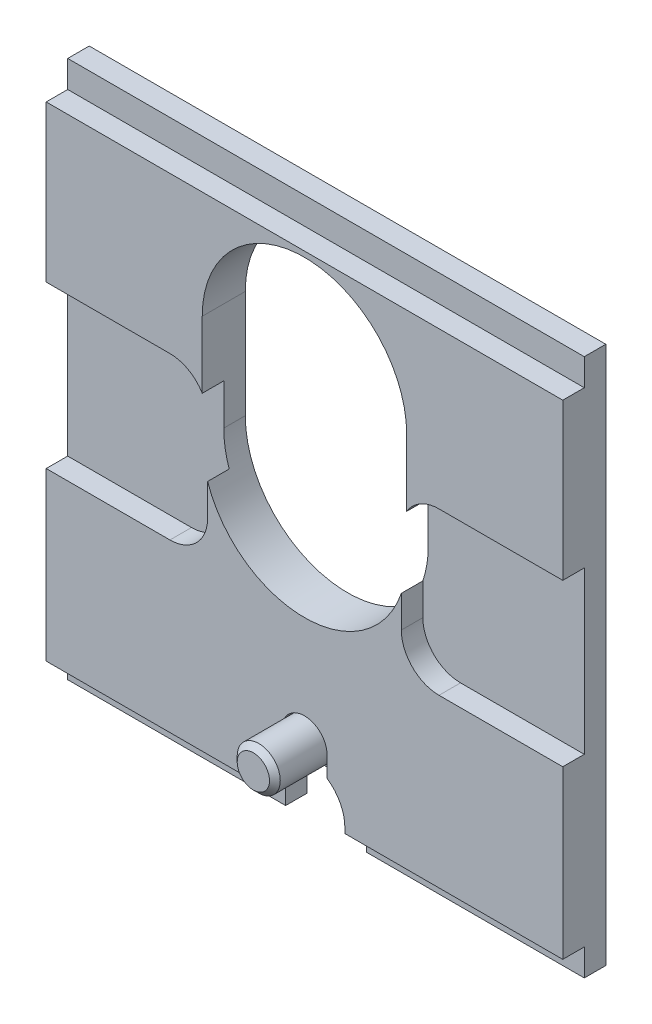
ISO-10303-21;
HEADER;
FILE_DESCRIPTION(('STEP AP214'),'2;1');
FILE_NAME('part.step','',(''),(''),'','','');
FILE_SCHEMA(('AUTOMOTIVE_DESIGN { 1 0 10303 214 1 1 1 1 }'));
ENDSEC;
DATA;
#1=APPLICATION_CONTEXT('core data for automotive mechanical design processes');
#2=APPLICATION_PROTOCOL_DEFINITION('international standard','automotive_design',2000,#1);
#3=PRODUCT_CONTEXT('',#1,'mechanical');
#4=PRODUCT('Part','Part','',(#3));
#5=PRODUCT_RELATED_PRODUCT_CATEGORY('part','',(#4));
#6=PRODUCT_DEFINITION_FORMATION('','',#4);
#7=PRODUCT_DEFINITION_CONTEXT('part definition',#1,'design');
#8=PRODUCT_DEFINITION('design','',#6,#7);
#9=PRODUCT_DEFINITION_SHAPE('','',#8);
#10=(LENGTH_UNIT() NAMED_UNIT(*) SI_UNIT(.MILLI.,.METRE.));
#11=(NAMED_UNIT(*) PLANE_ANGLE_UNIT() SI_UNIT($,.RADIAN.));
#12=(NAMED_UNIT(*) SI_UNIT($,.STERADIAN.) SOLID_ANGLE_UNIT());
#13=UNCERTAINTY_MEASURE_WITH_UNIT(LENGTH_MEASURE(1.E-05),#10,'distance_accuracy_value','');
#14=(GEOMETRIC_REPRESENTATION_CONTEXT(3) GLOBAL_UNCERTAINTY_ASSIGNED_CONTEXT((#13)) GLOBAL_UNIT_ASSIGNED_CONTEXT((#10,
#11,#12)) REPRESENTATION_CONTEXT('',''));
#15=CARTESIAN_POINT('',(0.,0.,0.));
#16=DIRECTION('',(0.,0.,1.));
#17=DIRECTION('',(1.,0.,0.));
#18=AXIS2_PLACEMENT_3D('',#15,#16,#17);
#19=CARTESIAN_POINT('',(0.,-70.4931459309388,-4.5));
#20=DIRECTION('',(0.,0.,-1.));
#21=DIRECTION('',(-1.,0.,0.));
#22=AXIS2_PLACEMENT_3D('',#19,#20,#21);
#23=PLANE('',#22);
#24=CARTESIAN_POINT('',(0.,-76.9931459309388,-4.5));
#25=DIRECTION('',(0.,0.,1.));
#26=DIRECTION('',(1.,0.,0.));
#27=AXIS2_PLACEMENT_3D('',#24,#25,#26);
#28=CIRCLE('',#27,4.);
#29=CARTESIAN_POINT('',(3.99999999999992,-76.9931459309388,-4.5));
#30=VERTEX_POINT('',#29);
#31=EDGE_CURVE('E464',#30,#30,#28,.T.);
#32=ORIENTED_EDGE('',*,*,#31,.F.);
#33=EDGE_LOOP('',(#32));
#34=FACE_BOUND('',#33,.T.);
#35=DIRECTION('',(0.,1.,0.));
#36=VECTOR('',#35,1.);
#37=CARTESIAN_POINT('',(-4.2,-70.4931459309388,-4.5));
#38=LINE('',#37,#36);
#39=CARTESIAN_POINT('',(-4.2,-80.7794513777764,-4.5));
#40=VERTEX_POINT('',#39);
#41=CARTESIAN_POINT('',(-4.2,-76.9931459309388,-4.5));
#42=VERTEX_POINT('',#41);
#43=EDGE_CURVE('E9',#40,#42,#38,.T.);
#44=ORIENTED_EDGE('',*,*,#43,.F.);
#45=CARTESIAN_POINT('',(0.,-86.9931459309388,-4.5));
#46=DIRECTION('',(0.,0.,-1.));
#47=DIRECTION('',(0.,1.,0.));
#48=AXIS2_PLACEMENT_3D('',#45,#46,#47);
#49=CIRCLE('',#48,7.5);
#50=CARTESIAN_POINT('',(-4.87442304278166,-81.2931459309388,-4.5));
#51=VERTEX_POINT('',#50);
#52=EDGE_CURVE('E24',#51,#40,#49,.T.);
#53=ORIENTED_EDGE('',*,*,#52,.F.);
#54=CARTESIAN_POINT('',(0.,-76.9931459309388,-4.5));
#55=DIRECTION('',(0.,0.,1.));
#56=DIRECTION('',(1.,0.,0.));
#57=AXIS2_PLACEMENT_3D('',#54,#55,#56);
#58=CIRCLE('',#57,6.5);
#59=CARTESIAN_POINT('',(4.87442304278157,-81.2931459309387,-4.5));
#60=VERTEX_POINT('',#59);
#61=EDGE_CURVE('E476',#51,#60,#58,.T.);
#62=ORIENTED_EDGE('',*,*,#61,.T.);
#63=CARTESIAN_POINT('',(0.,-86.9931459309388,-4.5));
#64=DIRECTION('',(0.,0.,-1.));
#65=DIRECTION('',(0.,1.,0.));
#66=AXIS2_PLACEMENT_3D('',#63,#64,#65);
#67=CIRCLE('',#66,7.5);
#68=CARTESIAN_POINT('',(4.2,-80.7794513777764,-4.5));
#69=VERTEX_POINT('',#68);
#70=EDGE_CURVE('E316',#69,#60,#67,.T.);
#71=ORIENTED_EDGE('',*,*,#70,.F.);
#72=DIRECTION('',(0.,-1.,0.));
#73=VECTOR('',#72,1.);
#74=CARTESIAN_POINT('',(4.2,-70.4931459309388,-4.5));
#75=LINE('',#74,#73);
#76=CARTESIAN_POINT('',(4.2,-76.9931459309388,-4.5));
#77=VERTEX_POINT('',#76);
#78=EDGE_CURVE('E311',#77,#69,#75,.T.);
#79=ORIENTED_EDGE('',*,*,#78,.F.);
#80=CARTESIAN_POINT('',(0.,-76.9931459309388,-4.5));
#81=DIRECTION('',(0.,0.,-1.));
#82=DIRECTION('',(-1.,0.,0.));
#83=AXIS2_PLACEMENT_3D('',#80,#81,#82);
#84=CIRCLE('',#83,4.2);
#85=EDGE_CURVE('E313',#42,#77,#84,.T.);
#86=ORIENTED_EDGE('',*,*,#85,.F.);
#87=EDGE_LOOP('',(#44,#53,#62,#71,#79,#86));
#88=FACE_BOUND('',#87,.T.);
#89=ADVANCED_FACE('F14',(#34,#88),#23,.F.);
#90=CARTESIAN_POINT('',(0.,-76.9931459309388,-9.5));
#91=DIRECTION('',(0.,0.,1.));
#92=DIRECTION('',(1.,0.,0.));
#93=AXIS2_PLACEMENT_3D('',#90,#91,#92);
#94=PLANE('',#93);
#95=DIRECTION('',(-0.5,-0.86602540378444,0.));
#96=VECTOR('',#95,1.);
#97=CARTESIAN_POINT('',(1.7320508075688,-79.9931459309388,-9.5));
#98=LINE('',#97,#96);
#99=CARTESIAN_POINT('',(3.46410161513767,-76.9931459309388,-9.5));
#100=VERTEX_POINT('',#99);
#101=CARTESIAN_POINT('',(1.7320508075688,-79.9931459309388,-9.5));
#102=VERTEX_POINT('',#101);
#103=EDGE_CURVE('E425',#100,#102,#98,.T.);
#104=ORIENTED_EDGE('',*,*,#103,.F.);
#105=DIRECTION('',(0.5,-0.866025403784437,0.));
#106=VECTOR('',#105,1.);
#107=CARTESIAN_POINT('',(3.46410161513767,-76.9931459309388,-9.5));
#108=LINE('',#107,#106);
#109=CARTESIAN_POINT('',(1.73205080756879,-73.9931459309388,-9.5));
#110=VERTEX_POINT('',#109);
#111=EDGE_CURVE('E421',#110,#100,#108,.T.);
#112=ORIENTED_EDGE('',*,*,#111,.F.);
#113=DIRECTION('',(1.,0.,0.));
#114=VECTOR('',#113,1.);
#115=CARTESIAN_POINT('',(1.73205080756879,-73.9931459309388,-9.5));
#116=LINE('',#115,#114);
#117=CARTESIAN_POINT('',(-1.73205080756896,-73.9931459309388,-9.5));
#118=VERTEX_POINT('',#117);
#119=EDGE_CURVE('E440',#118,#110,#116,.T.);
#120=ORIENTED_EDGE('',*,*,#119,.F.);
#121=DIRECTION('',(0.5,0.86602540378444,0.));
#122=VECTOR('',#121,1.);
#123=CARTESIAN_POINT('',(-1.73205080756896,-73.9931459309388,-9.5));
#124=LINE('',#123,#122);
#125=CARTESIAN_POINT('',(-3.46410161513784,-76.9931459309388,-9.5));
#126=VERTEX_POINT('',#125);
#127=EDGE_CURVE('E437',#126,#118,#124,.T.);
#128=ORIENTED_EDGE('',*,*,#127,.F.);
#129=DIRECTION('',(-0.5,0.866025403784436,0.));
#130=VECTOR('',#129,1.);
#131=CARTESIAN_POINT('',(-3.46410161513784,-76.9931459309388,-9.5));
#132=LINE('',#131,#130);
#133=CARTESIAN_POINT('',(-1.73205080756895,-79.9931459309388,-9.5));
#134=VERTEX_POINT('',#133);
#135=EDGE_CURVE('E434',#134,#126,#132,.T.);
#136=ORIENTED_EDGE('',*,*,#135,.F.);
#137=DIRECTION('',(-1.,0.,0.));
#138=VECTOR('',#137,1.);
#139=CARTESIAN_POINT('',(-1.73205080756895,-79.9931459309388,-9.5));
#140=LINE('',#139,#138);
#141=EDGE_CURVE('E430',#102,#134,#140,.T.);
#142=ORIENTED_EDGE('',*,*,#141,.F.);
#143=EDGE_LOOP('',(#104,#112,#120,#128,#136,#142));
#144=FACE_BOUND('',#143,.T.);
#145=CARTESIAN_POINT('',(0.,-76.9931459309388,-9.5));
#146=DIRECTION('',(0.,0.,1.));
#147=DIRECTION('',(1.,0.,0.));
#148=AXIS2_PLACEMENT_3D('',#145,#146,#147);
#149=CIRCLE('',#148,5.5);
#150=CARTESIAN_POINT('',(5.49999999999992,-76.9931459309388,-9.5));
#151=VERTEX_POINT('',#150);
#152=EDGE_CURVE('E481',#151,#151,#149,.F.);
#153=ORIENTED_EDGE('',*,*,#152,.T.);
#154=EDGE_LOOP('',(#153));
#155=FACE_BOUND('',#154,.T.);
#156=ADVANCED_FACE('F1152',(#144,#155),#94,.F.);
#157=CARTESIAN_POINT('',(0.,-76.9931459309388,9.5));
#158=DIRECTION('',(0.,0.,1.));
#159=DIRECTION('',(1.,0.,0.));
#160=AXIS2_PLACEMENT_3D('',#157,#158,#159);
#161=CYLINDRICAL_SURFACE('',#160,6.5);
#162=CARTESIAN_POINT('',(0.,-76.9931459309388,-8.5));
#163=DIRECTION('',(0.,0.,1.));
#164=DIRECTION('',(1.,0.,0.));
#165=AXIS2_PLACEMENT_3D('',#162,#163,#164);
#166=CIRCLE('',#165,6.5);
#167=CARTESIAN_POINT('',(6.49999999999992,-76.9931459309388,-8.5));
#168=VERTEX_POINT('',#167);
#169=EDGE_CURVE('E478',#168,#168,#166,.T.);
#170=ORIENTED_EDGE('',*,*,#169,.T.);
#171=EDGE_LOOP('',(#170));
#172=FACE_BOUND('',#171,.T.);
#173=ORIENTED_EDGE('',*,*,#61,.F.);
#174=EDGE_CURVE('E475',#60,#51,#58,.T.);
#175=ORIENTED_EDGE('',*,*,#174,.F.);
#176=EDGE_LOOP('',(#173,#175));
#177=FACE_BOUND('',#176,.T.);
#178=ADVANCED_FACE('F1144',(#172,#177),#161,.T.);
#179=CARTESIAN_POINT('',(0.,-76.9931459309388,9.5));
#180=DIRECTION('',(0.,0.,1.));
#181=DIRECTION('',(1.,0.,0.));
#182=AXIS2_PLACEMENT_3D('',#179,#180,#181);
#183=CYLINDRICAL_SURFACE('',#182,4.);
#184=CARTESIAN_POINT('',(0.,-76.9931459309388,8.5));
#185=DIRECTION('',(0.,0.,-1.));
#186=DIRECTION('',(-1.,0.,0.));
#187=AXIS2_PLACEMENT_3D('',#184,#185,#186);
#188=CIRCLE('',#187,4.);
#189=CARTESIAN_POINT('',(-4.00000000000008,-76.9931459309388,8.5));
#190=VERTEX_POINT('',#189);
#191=EDGE_CURVE('E487',#190,#190,#188,.T.);
#192=ORIENTED_EDGE('',*,*,#191,.T.);
#193=EDGE_LOOP('',(#192));
#194=FACE_BOUND('',#193,.T.);
#195=ORIENTED_EDGE('',*,*,#31,.T.);
#196=EDGE_LOOP('',(#195));
#197=FACE_BOUND('',#196,.T.);
#198=ADVANCED_FACE('F1136',(#194,#197),#183,.T.);
#199=CARTESIAN_POINT('',(0.,-72.9931459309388,9.5));
#200=DIRECTION('',(0.,0.,-1.));
#201=DIRECTION('',(-1.,0.,0.));
#202=AXIS2_PLACEMENT_3D('',#199,#200,#201);
#203=PLANE('',#202);
#204=CARTESIAN_POINT('',(0.,-76.9931459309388,9.5));
#205=DIRECTION('',(0.,0.,-1.));
#206=DIRECTION('',(-1.,0.,0.));
#207=AXIS2_PLACEMENT_3D('',#204,#205,#206);
#208=CIRCLE('',#207,3.);
#209=CARTESIAN_POINT('',(-3.00000000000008,-76.9931459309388,9.5));
#210=VERTEX_POINT('',#209);
#211=EDGE_CURVE('E484',#210,#210,#208,.F.);
#212=ORIENTED_EDGE('',*,*,#211,.T.);
#213=EDGE_LOOP('',(#212));
#214=FACE_BOUND('',#213,.T.);
#215=ADVANCED_FACE('F1128',(#214),#203,.F.);
#216=CARTESIAN_POINT('',(0.,-76.9931459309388,-8.5));
#217=DIRECTION('',(0.,0.,1.));
#218=DIRECTION('',(1.,0.,0.));
#219=AXIS2_PLACEMENT_3D('',#216,#217,#218);
#220=TOROIDAL_SURFACE('',#219,5.5,1.);
#221=ORIENTED_EDGE('',*,*,#152,.F.);
#222=EDGE_LOOP('',(#221));
#223=FACE_BOUND('',#222,.T.);
#224=ORIENTED_EDGE('',*,*,#169,.F.);
#225=EDGE_LOOP('',(#224));
#226=FACE_BOUND('',#225,.T.);
#227=ADVANCED_FACE('F1120',(#223,#226),#220,.T.);
#228=CARTESIAN_POINT('',(0.,-76.9931459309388,9.5));
#229=DIRECTION('',(0.,0.,-1.));
#230=DIRECTION('',(-1.,0.,0.));
#231=AXIS2_PLACEMENT_3D('',#228,#229,#230);
#232=CONICAL_SURFACE('',#231,3.,0.785398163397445);
#233=ORIENTED_EDGE('',*,*,#191,.F.);
#234=EDGE_LOOP('',(#233));
#235=FACE_BOUND('',#234,.T.);
#236=ORIENTED_EDGE('',*,*,#211,.F.);
#237=EDGE_LOOP('',(#236));
#238=FACE_BOUND('',#237,.T.);
#239=ADVANCED_FACE('F1113',(#235,#238),#232,.T.);
#240=CARTESIAN_POINT('',(3.46410161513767,-76.9931459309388,-6.5));
#241=DIRECTION('',(0.866025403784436,0.5,0.));
#242=DIRECTION('',(0.5,-0.866025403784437,0.));
#243=AXIS2_PLACEMENT_3D('',#240,#241,#242);
#244=PLANE('',#243);
#245=ORIENTED_EDGE('',*,*,#111,.T.);
#246=DIRECTION('',(0.,0.,-1.));
#247=VECTOR('',#246,1.);
#248=CARTESIAN_POINT('',(3.46410161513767,-76.9931459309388,-6.5));
#249=LINE('',#248,#247);
#250=CARTESIAN_POINT('',(3.46410161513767,-76.9931459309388,-6.5));
#251=VERTEX_POINT('',#250);
#252=EDGE_CURVE('E461',#251,#100,#249,.T.);
#253=ORIENTED_EDGE('',*,*,#252,.F.);
#254=DIRECTION('',(0.5,-0.866025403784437,0.));
#255=VECTOR('',#254,1.);
#256=CARTESIAN_POINT('',(3.46410161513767,-76.9931459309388,-6.5));
#257=LINE('',#256,#255);
#258=CARTESIAN_POINT('',(1.73205080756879,-73.9931459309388,-6.5));
#259=VERTEX_POINT('',#258);
#260=EDGE_CURVE('E443',#259,#251,#257,.T.);
#261=ORIENTED_EDGE('',*,*,#260,.F.);
#262=DIRECTION('',(0.,0.,-1.));
#263=VECTOR('',#262,1.);
#264=CARTESIAN_POINT('',(1.73205080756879,-73.9931459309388,-6.5));
#265=LINE('',#264,#263);
#266=EDGE_CURVE('E462',#259,#110,#265,.T.);
#267=ORIENTED_EDGE('',*,*,#266,.T.);
#268=EDGE_LOOP('',(#245,#253,#261,#267));
#269=FACE_BOUND('',#268,.T.);
#270=ADVANCED_FACE('F1105',(#269),#244,.F.);
#271=CARTESIAN_POINT('',(1.73205080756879,-73.9931459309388,-6.5));
#272=DIRECTION('',(0.,1.,0.));
#273=DIRECTION('',(1.,0.,0.));
#274=AXIS2_PLACEMENT_3D('',#271,#272,#273);
#275=PLANE('',#274);
#276=ORIENTED_EDGE('',*,*,#119,.T.);
#277=ORIENTED_EDGE('',*,*,#266,.F.);
#278=DIRECTION('',(1.,0.,0.));
#279=VECTOR('',#278,1.);
#280=CARTESIAN_POINT('',(1.73205080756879,-73.9931459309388,-6.5));
#281=LINE('',#280,#279);
#282=CARTESIAN_POINT('',(-1.73205080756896,-73.9931459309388,-6.5));
#283=VERTEX_POINT('',#282);
#284=EDGE_CURVE('E458',#283,#259,#281,.T.);
#285=ORIENTED_EDGE('',*,*,#284,.F.);
#286=DIRECTION('',(0.,0.,-1.));
#287=VECTOR('',#286,1.);
#288=CARTESIAN_POINT('',(-1.73205080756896,-73.9931459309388,-6.5));
#289=LINE('',#288,#287);
#290=EDGE_CURVE('E465',#283,#118,#289,.T.);
#291=ORIENTED_EDGE('',*,*,#290,.T.);
#292=EDGE_LOOP('',(#276,#277,#285,#291));
#293=FACE_BOUND('',#292,.T.);
#294=ADVANCED_FACE('F1097',(#293),#275,.F.);
#295=CARTESIAN_POINT('',(-1.73205080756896,-73.9931459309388,-6.5));
#296=DIRECTION('',(-0.86602540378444,0.5,0.));
#297=DIRECTION('',(0.5,0.86602540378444,0.));
#298=AXIS2_PLACEMENT_3D('',#295,#296,#297);
#299=PLANE('',#298);
#300=ORIENTED_EDGE('',*,*,#127,.T.);
#301=ORIENTED_EDGE('',*,*,#290,.F.);
#302=DIRECTION('',(0.5,0.86602540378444,0.));
#303=VECTOR('',#302,1.);
#304=CARTESIAN_POINT('',(-1.73205080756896,-73.9931459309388,-6.5));
#305=LINE('',#304,#303);
#306=CARTESIAN_POINT('',(-3.46410161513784,-76.9931459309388,-6.5));
#307=VERTEX_POINT('',#306);
#308=EDGE_CURVE('E455',#307,#283,#305,.T.);
#309=ORIENTED_EDGE('',*,*,#308,.F.);
#310=DIRECTION('',(0.,0.,-1.));
#311=VECTOR('',#310,1.);
#312=CARTESIAN_POINT('',(-3.46410161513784,-76.9931459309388,-6.5));
#313=LINE('',#312,#311);
#314=EDGE_CURVE('E467',#307,#126,#313,.T.);
#315=ORIENTED_EDGE('',*,*,#314,.T.);
#316=EDGE_LOOP('',(#300,#301,#309,#315));
#317=FACE_BOUND('',#316,.T.);
#318=ADVANCED_FACE('F1089',(#317),#299,.F.);
#319=CARTESIAN_POINT('',(-3.46410161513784,-76.9931459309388,-6.5));
#320=DIRECTION('',(-0.866025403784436,-0.5,0.));
#321=DIRECTION('',(-0.5,0.866025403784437,0.));
#322=AXIS2_PLACEMENT_3D('',#319,#320,#321);
#323=PLANE('',#322);
#324=ORIENTED_EDGE('',*,*,#135,.T.);
#325=ORIENTED_EDGE('',*,*,#314,.F.);
#326=DIRECTION('',(-0.5,0.866025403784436,0.));
#327=VECTOR('',#326,1.);
#328=CARTESIAN_POINT('',(-3.46410161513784,-76.9931459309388,-6.5));
#329=LINE('',#328,#327);
#330=CARTESIAN_POINT('',(-1.73205080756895,-79.9931459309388,-6.5));
#331=VERTEX_POINT('',#330);
#332=EDGE_CURVE('E452',#331,#307,#329,.T.);
#333=ORIENTED_EDGE('',*,*,#332,.F.);
#334=DIRECTION('',(0.,0.,-1.));
#335=VECTOR('',#334,1.);
#336=CARTESIAN_POINT('',(-1.73205080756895,-79.9931459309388,-6.5));
#337=LINE('',#336,#335);
#338=EDGE_CURVE('E469',#331,#134,#337,.T.);
#339=ORIENTED_EDGE('',*,*,#338,.T.);
#340=EDGE_LOOP('',(#324,#325,#333,#339));
#341=FACE_BOUND('',#340,.T.);
#342=ADVANCED_FACE('F1082',(#341),#323,.F.);
#343=CARTESIAN_POINT('',(-1.73205080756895,-79.9931459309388,-6.5));
#344=DIRECTION('',(0.,-1.,0.));
#345=DIRECTION('',(-1.,0.,0.));
#346=AXIS2_PLACEMENT_3D('',#343,#344,#345);
#347=PLANE('',#346);
#348=ORIENTED_EDGE('',*,*,#141,.T.);
#349=ORIENTED_EDGE('',*,*,#338,.F.);
#350=DIRECTION('',(-1.,0.,0.));
#351=VECTOR('',#350,1.);
#352=CARTESIAN_POINT('',(-1.73205080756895,-79.9931459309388,-6.5));
#353=LINE('',#352,#351);
#354=CARTESIAN_POINT('',(1.7320508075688,-79.9931459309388,-6.5));
#355=VERTEX_POINT('',#354);
#356=EDGE_CURVE('E449',#355,#331,#353,.T.);
#357=ORIENTED_EDGE('',*,*,#356,.F.);
#358=DIRECTION('',(0.,0.,-1.));
#359=VECTOR('',#358,1.);
#360=CARTESIAN_POINT('',(1.7320508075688,-79.9931459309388,-6.5));
#361=LINE('',#360,#359);
#362=EDGE_CURVE('E267',#355,#102,#361,.T.);
#363=ORIENTED_EDGE('',*,*,#362,.T.);
#364=EDGE_LOOP('',(#348,#349,#357,#363));
#365=FACE_BOUND('',#364,.T.);
#366=ADVANCED_FACE('F1074',(#365),#347,.F.);
#367=CARTESIAN_POINT('',(1.7320508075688,-79.9931459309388,-6.5));
#368=DIRECTION('',(0.86602540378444,-0.5,0.));
#369=DIRECTION('',(-0.5,-0.86602540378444,0.));
#370=AXIS2_PLACEMENT_3D('',#367,#368,#369);
#371=PLANE('',#370);
#372=ORIENTED_EDGE('',*,*,#103,.T.);
#373=ORIENTED_EDGE('',*,*,#362,.F.);
#374=DIRECTION('',(-0.5,-0.86602540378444,0.));
#375=VECTOR('',#374,1.);
#376=CARTESIAN_POINT('',(1.7320508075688,-79.9931459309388,-6.5));
#377=LINE('',#376,#375);
#378=EDGE_CURVE('E446',#251,#355,#377,.T.);
#379=ORIENTED_EDGE('',*,*,#378,.F.);
#380=ORIENTED_EDGE('',*,*,#252,.T.);
#381=EDGE_LOOP('',(#372,#373,#379,#380));
#382=FACE_BOUND('',#381,.T.);
#383=ADVANCED_FACE('F876',(#382),#371,.F.);
#384=CARTESIAN_POINT('',(3.46410161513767,-76.9931459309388,-6.5));
#385=DIRECTION('',(0.,0.,-1.));
#386=DIRECTION('',(-1.,0.,0.));
#387=AXIS2_PLACEMENT_3D('',#384,#385,#386);
#388=PLANE('',#387);
#389=ORIENTED_EDGE('',*,*,#260,.T.);
#390=ORIENTED_EDGE('',*,*,#378,.T.);
#391=ORIENTED_EDGE('',*,*,#356,.T.);
#392=ORIENTED_EDGE('',*,*,#332,.T.);
#393=ORIENTED_EDGE('',*,*,#308,.T.);
#394=ORIENTED_EDGE('',*,*,#284,.T.);
#395=EDGE_LOOP('',(#389,#390,#391,#392,#393,#394));
#396=FACE_BOUND('',#395,.T.);
#397=ADVANCED_FACE('F867',(#396),#388,.T.);
#398=CARTESIAN_POINT('',(-25.,-33.9931459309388,-4.));
#399=DIRECTION('',(0.,0.,1.));
#400=DIRECTION('',(1.,0.,0.));
#401=AXIS2_PLACEMENT_3D('',#398,#399,#400);
#402=CYLINDRICAL_SURFACE('',#401,7.);
#403=CARTESIAN_POINT('',(-25.,-33.9931459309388,0.));
#404=DIRECTION('',(0.,0.,1.));
#405=DIRECTION('',(1.,0.,0.));
#406=AXIS2_PLACEMENT_3D('',#403,#404,#405);
#407=CIRCLE('',#406,7.);
#408=CARTESIAN_POINT('',(-19.,-30.3875946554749,0.));
#409=VERTEX_POINT('',#408);
#410=CARTESIAN_POINT('',(-25.,-26.9931459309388,0.));
#411=VERTEX_POINT('',#410);
#412=EDGE_CURVE('E541',#409,#411,#407,.T.);
#413=ORIENTED_EDGE('',*,*,#412,.T.);
#414=DIRECTION('',(0.,0.,1.));
#415=VECTOR('',#414,1.);
#416=CARTESIAN_POINT('',(-25.,-26.9931459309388,-4.));
#417=LINE('',#416,#415);
#418=CARTESIAN_POINT('',(-25.,-26.9931459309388,-4.));
#419=VERTEX_POINT('',#418);
#420=EDGE_CURVE('E564',#419,#411,#417,.T.);
#421=ORIENTED_EDGE('',*,*,#420,.F.);
#422=CARTESIAN_POINT('',(-25.,-33.9931459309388,-4.));
#423=DIRECTION('',(0.,0.,1.));
#424=DIRECTION('',(1.,0.,0.));
#425=AXIS2_PLACEMENT_3D('',#422,#423,#424);
#426=CIRCLE('',#425,7.);
#427=CARTESIAN_POINT('',(-19.,-30.3875946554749,-4.));
#428=VERTEX_POINT('',#427);
#429=EDGE_CURVE('E554',#428,#419,#426,.T.);
#430=ORIENTED_EDGE('',*,*,#429,.F.);
#431=DIRECTION('',(0.,0.,1.));
#432=VECTOR('',#431,1.);
#433=CARTESIAN_POINT('',(-19.,-30.3875946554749,-4.));
#434=LINE('',#433,#432);
#435=EDGE_CURVE('E410',#409,#428,#434,.F.);
#436=ORIENTED_EDGE('',*,*,#435,.F.);
#437=EDGE_LOOP('',(#413,#421,#430,#436));
#438=FACE_BOUND('',#437,.T.);
#439=ADVANCED_FACE('F865',(#438),#402,.F.);
#440=CARTESIAN_POINT('',(25.,-33.9931459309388,-4.));
#441=DIRECTION('',(0.,0.,1.));
#442=DIRECTION('',(1.,0.,0.));
#443=AXIS2_PLACEMENT_3D('',#440,#441,#442);
#444=CYLINDRICAL_SURFACE('',#443,7.);
#445=CARTESIAN_POINT('',(25.,-33.9931459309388,-4.));
#446=DIRECTION('',(0.,0.,1.));
#447=DIRECTION('',(-1.,0.,0.));
#448=AXIS2_PLACEMENT_3D('',#445,#446,#447);
#449=CIRCLE('',#448,7.);
#450=CARTESIAN_POINT('',(25.,-26.9931459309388,-4.));
#451=VERTEX_POINT('',#450);
#452=CARTESIAN_POINT('',(19.,-30.3875946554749,-4.));
#453=VERTEX_POINT('',#452);
#454=EDGE_CURVE('E258',#451,#453,#449,.T.);
#455=ORIENTED_EDGE('',*,*,#454,.F.);
#456=DIRECTION('',(0.,0.,1.));
#457=VECTOR('',#456,1.);
#458=CARTESIAN_POINT('',(25.,-26.9931459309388,-4.));
#459=LINE('',#458,#457);
#460=CARTESIAN_POINT('',(25.,-26.9931459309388,0.));
#461=VERTEX_POINT('',#460);
#462=EDGE_CURVE('E523',#451,#461,#459,.T.);
#463=ORIENTED_EDGE('',*,*,#462,.T.);
#464=CARTESIAN_POINT('',(25.,-33.9931459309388,0.));
#465=DIRECTION('',(0.,0.,1.));
#466=DIRECTION('',(-1.,0.,0.));
#467=AXIS2_PLACEMENT_3D('',#464,#465,#466);
#468=CIRCLE('',#467,7.);
#469=CARTESIAN_POINT('',(19.,-30.3875946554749,0.));
#470=VERTEX_POINT('',#469);
#471=EDGE_CURVE('E500',#461,#470,#468,.T.);
#472=ORIENTED_EDGE('',*,*,#471,.T.);
#473=DIRECTION('',(0.,0.,1.));
#474=VECTOR('',#473,1.);
#475=CARTESIAN_POINT('',(19.,-30.3875946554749,-4.));
#476=LINE('',#475,#474);
#477=EDGE_CURVE('E415',#453,#470,#476,.T.);
#478=ORIENTED_EDGE('',*,*,#477,.F.);
#479=EDGE_LOOP('',(#455,#463,#472,#478));
#480=FACE_BOUND('',#479,.T.);
#481=ADVANCED_FACE('F820',(#480),#444,.F.);
#482=CARTESIAN_POINT('',(25.,-26.9931459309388,-4.));
#483=DIRECTION('',(0.,1.,0.));
#484=DIRECTION('',(1.,0.,0.));
#485=AXIS2_PLACEMENT_3D('',#482,#483,#484);
#486=PLANE('',#485);
#487=DIRECTION('',(-1.,0.,0.));
#488=VECTOR('',#487,1.);
#489=CARTESIAN_POINT('',(25.,-26.9931459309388,0.));
#490=LINE('',#489,#488);
#491=CARTESIAN_POINT('',(48.,-26.9931459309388,0.));
#492=VERTEX_POINT('',#491);
#493=EDGE_CURVE('E497',#492,#461,#490,.T.);
#494=ORIENTED_EDGE('',*,*,#493,.T.);
#495=ORIENTED_EDGE('',*,*,#462,.F.);
#496=DIRECTION('',(-1.,0.,0.));
#497=VECTOR('',#496,1.);
#498=CARTESIAN_POINT('',(25.,-26.9931459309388,-4.));
#499=LINE('',#498,#497);
#500=CARTESIAN_POINT('',(48.,-26.9931459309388,-4.));
#501=VERTEX_POINT('',#500);
#502=EDGE_CURVE('E513',#501,#451,#499,.T.);
#503=ORIENTED_EDGE('',*,*,#502,.F.);
#504=DIRECTION('',(0.,0.,1.));
#505=VECTOR('',#504,1.);
#506=CARTESIAN_POINT('',(48.,-26.9931459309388,-4.));
#507=LINE('',#506,#505);
#508=EDGE_CURVE('E525',#501,#492,#507,.T.);
#509=ORIENTED_EDGE('',*,*,#508,.T.);
#510=EDGE_LOOP('',(#494,#495,#503,#509));
#511=FACE_BOUND('',#510,.T.);
#512=ADVANCED_FACE('F807',(#511),#486,.F.);
#513=CARTESIAN_POINT('',(48.,7.00685406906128,-4.));
#514=DIRECTION('',(0.,0.,-1.));
#515=DIRECTION('',(0.,-1.,0.));
#516=AXIS2_PLACEMENT_3D('',#513,#514,#515);
#517=PLANE('',#516);
#518=DIRECTION('',(0.,-1.,0.));
#519=VECTOR('',#518,1.);
#520=CARTESIAN_POINT('',(-48.,7.00685406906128,-4.));
#521=LINE('',#520,#519);
#522=CARTESIAN_POINT('',(-48.,7.00685406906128,-4.));
#523=VERTEX_POINT('',#522);
#524=CARTESIAN_POINT('',(-48.,2.00685406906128,-4.));
#525=VERTEX_POINT('',#524);
#526=EDGE_CURVE('E601',#523,#525,#521,.T.);
#527=ORIENTED_EDGE('',*,*,#526,.T.);
#528=DIRECTION('',(-1.,0.,0.));
#529=VECTOR('',#528,1.);
#530=CARTESIAN_POINT('',(48.,2.00685406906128,-4.));
#531=LINE('',#530,#529);
#532=CARTESIAN_POINT('',(48.,2.00685406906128,-4.));
#533=VERTEX_POINT('',#532);
#534=EDGE_CURVE('E613',#533,#525,#531,.T.);
#535=ORIENTED_EDGE('',*,*,#534,.F.);
#536=DIRECTION('',(0.,-1.,0.));
#537=VECTOR('',#536,1.);
#538=CARTESIAN_POINT('',(48.,7.00685406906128,-4.));
#539=LINE('',#538,#537);
#540=CARTESIAN_POINT('',(48.,7.00685406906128,-4.));
#541=VERTEX_POINT('',#540);
#542=EDGE_CURVE('E607',#541,#533,#539,.T.);
#543=ORIENTED_EDGE('',*,*,#542,.F.);
#544=DIRECTION('',(-1.,0.,0.));
#545=VECTOR('',#544,1.);
#546=CARTESIAN_POINT('',(48.,7.00685406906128,-4.));
#547=LINE('',#546,#545);
#548=EDGE_CURVE('E614',#541,#523,#547,.T.);
#549=ORIENTED_EDGE('',*,*,#548,.T.);
#550=EDGE_LOOP('',(#527,#535,#543,#549));
#551=FACE_BOUND('',#550,.T.);
#552=ADVANCED_FACE('F761',(#551),#517,.F.);
#553=CARTESIAN_POINT('',(48.,2.00685406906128,-4.));
#554=DIRECTION('',(0.,-1.,0.));
#555=DIRECTION('',(0.,0.,1.));
#556=AXIS2_PLACEMENT_3D('',#553,#554,#555);
#557=PLANE('',#556);
#558=DIRECTION('',(0.,0.,1.));
#559=VECTOR('',#558,1.);
#560=CARTESIAN_POINT('',(-48.,2.00685406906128,-4.));
#561=LINE('',#560,#559);
#562=CARTESIAN_POINT('',(-48.,2.00685406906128,0.));
#563=VERTEX_POINT('',#562);
#564=EDGE_CURVE('E604',#525,#563,#561,.T.);
#565=ORIENTED_EDGE('',*,*,#564,.T.);
#566=DIRECTION('',(-1.,0.,0.));
#567=VECTOR('',#566,1.);
#568=CARTESIAN_POINT('',(48.,2.00685406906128,0.));
#569=LINE('',#568,#567);
#570=CARTESIAN_POINT('',(48.,2.00685406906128,0.));
#571=VERTEX_POINT('',#570);
#572=EDGE_CURVE('E617',#571,#563,#569,.T.);
#573=ORIENTED_EDGE('',*,*,#572,.F.);
#574=DIRECTION('',(0.,0.,1.));
#575=VECTOR('',#574,1.);
#576=CARTESIAN_POINT('',(48.,2.00685406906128,-4.));
#577=LINE('',#576,#575);
#578=EDGE_CURVE('E610',#533,#571,#577,.T.);
#579=ORIENTED_EDGE('',*,*,#578,.F.);
#580=ORIENTED_EDGE('',*,*,#534,.T.);
#581=EDGE_LOOP('',(#565,#573,#579,#580));
#582=FACE_BOUND('',#581,.T.);
#583=ADVANCED_FACE('F749',(#582),#557,.F.);
#584=CARTESIAN_POINT('',(107.963867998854,-42.9931459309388,0.));
#585=DIRECTION('',(0.,0.,1.));
#586=DIRECTION('',(1.,0.,0.));
#587=AXIS2_PLACEMENT_3D('',#584,#585,#586);
#588=PLANE('',#587);
#589=ORIENTED_EDGE('',*,*,#471,.F.);
#590=ORIENTED_EDGE('',*,*,#493,.F.);
#591=DIRECTION('',(0.,1.,0.));
#592=VECTOR('',#591,1.);
#593=CARTESIAN_POINT('',(48.,-42.9931459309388,0.));
#594=LINE('',#593,#592);
#595=EDGE_CURVE('E368',#492,#571,#594,.T.);
#596=ORIENTED_EDGE('',*,*,#595,.T.);
#597=ORIENTED_EDGE('',*,*,#572,.T.);
#598=DIRECTION('',(0.,1.,0.));
#599=VECTOR('',#598,1.);
#600=CARTESIAN_POINT('',(-48.,-42.9931459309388,0.));
#601=LINE('',#600,#599);
#602=CARTESIAN_POINT('',(-48.,-26.9931459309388,0.));
#603=VERTEX_POINT('',#602);
#604=EDGE_CURVE('E364',#603,#563,#601,.T.);
#605=ORIENTED_EDGE('',*,*,#604,.F.);
#606=DIRECTION('',(-1.,0.,0.));
#607=VECTOR('',#606,1.);
#608=CARTESIAN_POINT('',(-25.,-26.9931459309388,0.));
#609=LINE('',#608,#607);
#610=EDGE_CURVE('E543',#411,#603,#609,.T.);
#611=ORIENTED_EDGE('',*,*,#610,.F.);
#612=ORIENTED_EDGE('',*,*,#412,.F.);
#613=DIRECTION('',(0.,1.,0.));
#614=VECTOR('',#613,1.);
#615=CARTESIAN_POINT('',(-19.,-17.9931459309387,0.));
#616=LINE('',#615,#614);
#617=CARTESIAN_POINT('',(-19.,-17.9931459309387,0.));
#618=VERTEX_POINT('',#617);
#619=EDGE_CURVE('E638',#409,#618,#616,.T.);
#620=ORIENTED_EDGE('',*,*,#619,.T.);
#621=CARTESIAN_POINT('',(0.,-17.9931459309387,0.));
#622=DIRECTION('',(0.,0.,-1.));
#623=DIRECTION('',(-1.,0.,0.));
#624=AXIS2_PLACEMENT_3D('',#621,#622,#623);
#625=CIRCLE('',#624,19.);
#626=CARTESIAN_POINT('',(19.,-17.9931459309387,0.));
#627=VERTEX_POINT('',#626);
#628=EDGE_CURVE('E631',#618,#627,#625,.T.);
#629=ORIENTED_EDGE('',*,*,#628,.T.);
#630=DIRECTION('',(0.,-1.,0.));
#631=VECTOR('',#630,1.);
#632=CARTESIAN_POINT('',(19.,-17.9931459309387,0.));
#633=LINE('',#632,#631);
#634=EDGE_CURVE('E634',#627,#470,#633,.T.);
#635=ORIENTED_EDGE('',*,*,#634,.T.);
#636=EDGE_LOOP('',(#589,#590,#596,#597,#605,#611,#612,#620,#629,#635));
#637=FACE_BOUND('',#636,.T.);
#638=ADVANCED_FACE('F740',(#637),#588,.T.);
#639=CARTESIAN_POINT('',(-25.,-26.9931459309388,-4.));
#640=DIRECTION('',(0.,1.,0.));
#641=DIRECTION('',(0.,0.,-1.));
#642=AXIS2_PLACEMENT_3D('',#639,#640,#641);
#643=PLANE('',#642);
#644=ORIENTED_EDGE('',*,*,#610,.T.);
#645=DIRECTION('',(0.,0.,1.));
#646=VECTOR('',#645,1.);
#647=CARTESIAN_POINT('',(-48.,-26.9931459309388,-4.));
#648=LINE('',#647,#646);
#649=CARTESIAN_POINT('',(-48.,-26.9931459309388,-4.));
#650=VERTEX_POINT('',#649);
#651=EDGE_CURVE('E560',#650,#603,#648,.T.);
#652=ORIENTED_EDGE('',*,*,#651,.F.);
#653=DIRECTION('',(-1.,0.,0.));
#654=VECTOR('',#653,1.);
#655=CARTESIAN_POINT('',(-25.,-26.9931459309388,-4.));
#656=LINE('',#655,#654);
#657=EDGE_CURVE('E556',#419,#650,#656,.T.);
#658=ORIENTED_EDGE('',*,*,#657,.F.);
#659=ORIENTED_EDGE('',*,*,#420,.T.);
#660=EDGE_LOOP('',(#644,#652,#658,#659));
#661=FACE_BOUND('',#660,.T.);
#662=ADVANCED_FACE('F748',(#661),#643,.F.);
#663=CARTESIAN_POINT('',(-25.,-49.9931459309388,-4.));
#664=DIRECTION('',(0.,0.,1.));
#665=DIRECTION('',(1.,0.,0.));
#666=AXIS2_PLACEMENT_3D('',#663,#664,#665);
#667=PLANE('',#666);
#668=DIRECTION('',(0.,1.,0.));
#669=VECTOR('',#668,1.);
#670=CARTESIAN_POINT('',(-19.,-17.9931459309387,-4.));
#671=LINE('',#670,#669);
#672=CARTESIAN_POINT('',(-19.,-37.9931459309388,-4.));
#673=VERTEX_POINT('',#672);
#674=EDGE_CURVE('E563',#673,#428,#671,.T.);
#675=ORIENTED_EDGE('',*,*,#674,.T.);
#676=ORIENTED_EDGE('',*,*,#429,.T.);
#677=ORIENTED_EDGE('',*,*,#657,.T.);
#678=DIRECTION('',(0.,-1.,0.));
#679=VECTOR('',#678,1.);
#680=CARTESIAN_POINT('',(-48.,-26.9931459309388,-4.));
#681=LINE('',#680,#679);
#682=CARTESIAN_POINT('',(-48.,-56.9931459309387,-4.));
#683=VERTEX_POINT('',#682);
#684=EDGE_CURVE('E545',#650,#683,#681,.T.);
#685=ORIENTED_EDGE('',*,*,#684,.T.);
#686=DIRECTION('',(1.,0.,0.));
#687=VECTOR('',#686,1.);
#688=CARTESIAN_POINT('',(-48.,-56.9931459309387,-4.));
#689=LINE('',#688,#687);
#690=CARTESIAN_POINT('',(-25.,-56.9931459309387,-4.));
#691=VERTEX_POINT('',#690);
#692=EDGE_CURVE('E548',#683,#691,#689,.T.);
#693=ORIENTED_EDGE('',*,*,#692,.T.);
#694=CARTESIAN_POINT('',(-25.,-49.9931459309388,-4.));
#695=DIRECTION('',(0.,0.,1.));
#696=DIRECTION('',(1.,0.,0.));
#697=AXIS2_PLACEMENT_3D('',#694,#695,#696);
#698=CIRCLE('',#697,7.);
#699=CARTESIAN_POINT('',(-18.,-49.9931459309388,-4.));
#700=VERTEX_POINT('',#699);
#701=EDGE_CURVE('E551',#691,#700,#698,.T.);
#702=ORIENTED_EDGE('',*,*,#701,.T.);
#703=DIRECTION('',(0.,1.,0.));
#704=VECTOR('',#703,1.);
#705=CARTESIAN_POINT('',(-18.,-49.9931459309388,-4.));
#706=LINE('',#705,#704);
#707=CARTESIAN_POINT('',(-18.,-44.0759084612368,-4.));
#708=VERTEX_POINT('',#707);
#709=EDGE_CURVE('E251',#700,#708,#706,.T.);
#710=ORIENTED_EDGE('',*,*,#709,.T.);
#711=CARTESIAN_POINT('',(0.,-37.9931459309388,-4.));
#712=DIRECTION('',(0.,0.,1.));
#713=DIRECTION('',(1.,0.,0.));
#714=AXIS2_PLACEMENT_3D('',#711,#712,#713);
#715=CIRCLE('',#714,19.);
#716=EDGE_CURVE('E405',#708,#673,#715,.F.);
#717=ORIENTED_EDGE('',*,*,#716,.T.);
#718=EDGE_LOOP('',(#675,#676,#677,#685,#693,#702,#710,#717));
#719=FACE_BOUND('',#718,.T.);
#720=ADVANCED_FACE('F757',(#719),#667,.T.);
#721=CARTESIAN_POINT('',(25.,-49.9931459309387,-4.));
#722=DIRECTION('',(0.,0.,-1.));
#723=DIRECTION('',(-1.,0.,0.));
#724=AXIS2_PLACEMENT_3D('',#721,#722,#723);
#725=PLANE('',#724);
#726=DIRECTION('',(0.,-1.,0.));
#727=VECTOR('',#726,1.);
#728=CARTESIAN_POINT('',(18.,-49.9931459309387,-4.));
#729=LINE('',#728,#727);
#730=CARTESIAN_POINT('',(18.,-44.0759084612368,-4.));
#731=VERTEX_POINT('',#730);
#732=CARTESIAN_POINT('',(18.,-49.9931459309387,-4.));
#733=VERTEX_POINT('',#732);
#734=EDGE_CURVE('E516',#731,#733,#729,.T.);
#735=ORIENTED_EDGE('',*,*,#734,.T.);
#736=CARTESIAN_POINT('',(25.,-49.9931459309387,-4.));
#737=DIRECTION('',(0.,0.,1.));
#738=DIRECTION('',(-1.,0.,0.));
#739=AXIS2_PLACEMENT_3D('',#736,#737,#738);
#740=CIRCLE('',#739,7.);
#741=CARTESIAN_POINT('',(25.,-56.9931459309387,-4.));
#742=VERTEX_POINT('',#741);
#743=EDGE_CURVE('E504',#733,#742,#740,.T.);
#744=ORIENTED_EDGE('',*,*,#743,.T.);
#745=DIRECTION('',(1.,0.,0.));
#746=VECTOR('',#745,1.);
#747=CARTESIAN_POINT('',(48.,-56.9931459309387,-4.));
#748=LINE('',#747,#746);
#749=CARTESIAN_POINT('',(48.,-56.9931459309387,-4.));
#750=VERTEX_POINT('',#749);
#751=EDGE_CURVE('E507',#742,#750,#748,.T.);
#752=ORIENTED_EDGE('',*,*,#751,.T.);
#753=DIRECTION('',(0.,1.,0.));
#754=VECTOR('',#753,1.);
#755=CARTESIAN_POINT('',(48.,-26.9931459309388,-4.));
#756=LINE('',#755,#754);
#757=EDGE_CURVE('E510',#750,#501,#756,.T.);
#758=ORIENTED_EDGE('',*,*,#757,.T.);
#759=ORIENTED_EDGE('',*,*,#502,.T.);
#760=ORIENTED_EDGE('',*,*,#454,.T.);
#761=DIRECTION('',(0.,1.,0.));
#762=VECTOR('',#761,1.);
#763=CARTESIAN_POINT('',(19.,-17.9931459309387,-4.));
#764=LINE('',#763,#762);
#765=CARTESIAN_POINT('',(19.,-37.9931459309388,-4.));
#766=VERTEX_POINT('',#765);
#767=EDGE_CURVE('E413',#766,#453,#764,.T.);
#768=ORIENTED_EDGE('',*,*,#767,.F.);
#769=CARTESIAN_POINT('',(0.,-37.9931459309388,-4.));
#770=DIRECTION('',(0.,0.,-1.));
#771=DIRECTION('',(-1.,0.,0.));
#772=AXIS2_PLACEMENT_3D('',#769,#770,#771);
#773=CIRCLE('',#772,19.);
#774=EDGE_CURVE('E522',#731,#766,#773,.F.);
#775=ORIENTED_EDGE('',*,*,#774,.F.);
#776=EDGE_LOOP('',(#735,#744,#752,#758,#759,#760,#768,#775));
#777=FACE_BOUND('',#776,.T.);
#778=ADVANCED_FACE('F810',(#777),#725,.F.);
#779=CARTESIAN_POINT('',(107.963867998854,7.00685406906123,-8.));
#780=DIRECTION('',(0.,-1.,0.));
#781=DIRECTION('',(-1.,0.,0.));
#782=AXIS2_PLACEMENT_3D('',#779,#780,#781);
#783=PLANE('',#782);
#784=DIRECTION('',(0.,0.,1.));
#785=VECTOR('',#784,1.);
#786=CARTESIAN_POINT('',(-48.,7.00685406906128,-8.));
#787=LINE('',#786,#785);
#788=CARTESIAN_POINT('',(-48.,7.00685406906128,-8.));
#789=VERTEX_POINT('',#788);
#790=EDGE_CURVE('E393',#789,#523,#787,.T.);
#791=ORIENTED_EDGE('',*,*,#790,.T.);
#792=ORIENTED_EDGE('',*,*,#548,.F.);
#793=DIRECTION('',(0.,0.,1.));
#794=VECTOR('',#793,1.);
#795=CARTESIAN_POINT('',(48.,7.00685406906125,-8.));
#796=LINE('',#795,#794);
#797=CARTESIAN_POINT('',(48.,7.00685406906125,-8.));
#798=VERTEX_POINT('',#797);
#799=EDGE_CURVE('E390',#798,#541,#796,.T.);
#800=ORIENTED_EDGE('',*,*,#799,.F.);
#801=DIRECTION('',(1.,0.,0.));
#802=VECTOR('',#801,1.);
#803=CARTESIAN_POINT('',(107.963867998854,7.00685406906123,-8.));
#804=LINE('',#803,#802);
#805=EDGE_CURVE('E375',#789,#798,#804,.T.);
#806=ORIENTED_EDGE('',*,*,#805,.F.);
#807=EDGE_LOOP('',(#791,#792,#800,#806));
#808=FACE_BOUND('',#807,.T.);
#809=ADVANCED_FACE('F797',(#808),#783,.F.);
#810=CARTESIAN_POINT('',(-19.,-17.9931459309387,0.));
#811=DIRECTION('',(-1.,0.,0.));
#812=DIRECTION('',(0.,1.,0.));
#813=AXIS2_PLACEMENT_3D('',#810,#811,#812);
#814=PLANE('',#813);
#815=ORIENTED_EDGE('',*,*,#619,.F.);
#816=ORIENTED_EDGE('',*,*,#435,.T.);
#817=ORIENTED_EDGE('',*,*,#674,.F.);
#818=DIRECTION('',(0.,0.,-1.));
#819=VECTOR('',#818,1.);
#820=CARTESIAN_POINT('',(-19.,-37.9931459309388,0.));
#821=LINE('',#820,#819);
#822=CARTESIAN_POINT('',(-19.,-37.9931459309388,-8.));
#823=VERTEX_POINT('',#822);
#824=EDGE_CURVE('E644',#673,#823,#821,.T.);
#825=ORIENTED_EDGE('',*,*,#824,.T.);
#826=DIRECTION('',(0.,1.,0.));
#827=VECTOR('',#826,1.);
#828=CARTESIAN_POINT('',(-19.,-17.9931459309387,-8.));
#829=LINE('',#828,#827);
#830=CARTESIAN_POINT('',(-19.,-17.9931459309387,-8.));
#831=VERTEX_POINT('',#830);
#832=EDGE_CURVE('E628',#823,#831,#829,.T.);
#833=ORIENTED_EDGE('',*,*,#832,.T.);
#834=DIRECTION('',(0.,0.,-1.));
#835=VECTOR('',#834,1.);
#836=CARTESIAN_POINT('',(-19.,-17.9931459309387,0.));
#837=LINE('',#836,#835);
#838=EDGE_CURVE('E641',#618,#831,#837,.T.);
#839=ORIENTED_EDGE('',*,*,#838,.F.);
#840=EDGE_LOOP('',(#815,#816,#817,#825,#833,#839));
#841=FACE_BOUND('',#840,.T.);
#842=ADVANCED_FACE('F809',(#841),#814,.F.);
#843=CARTESIAN_POINT('',(0.,-17.9931459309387,0.));
#844=DIRECTION('',(0.,0.,-1.));
#845=DIRECTION('',(-1.,0.,0.));
#846=AXIS2_PLACEMENT_3D('',#843,#844,#845);
#847=CYLINDRICAL_SURFACE('',#846,19.);
#848=CARTESIAN_POINT('',(0.,-17.9931459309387,-8.));
#849=DIRECTION('',(0.,0.,-1.));
#850=DIRECTION('',(-1.,0.,0.));
#851=AXIS2_PLACEMENT_3D('',#848,#849,#850);
#852=CIRCLE('',#851,19.);
#853=CARTESIAN_POINT('',(19.,-17.9931459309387,-8.));
#854=VERTEX_POINT('',#853);
#855=EDGE_CURVE('E616',#831,#854,#852,.T.);
#856=ORIENTED_EDGE('',*,*,#855,.T.);
#857=DIRECTION('',(0.,0.,-1.));
#858=VECTOR('',#857,1.);
#859=CARTESIAN_POINT('',(19.,-17.9931459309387,0.));
#860=LINE('',#859,#858);
#861=EDGE_CURVE('E640',#627,#854,#860,.T.);
#862=ORIENTED_EDGE('',*,*,#861,.F.);
#863=ORIENTED_EDGE('',*,*,#628,.F.);
#864=ORIENTED_EDGE('',*,*,#838,.T.);
#865=EDGE_LOOP('',(#856,#862,#863,#864));
#866=FACE_BOUND('',#865,.T.);
#867=ADVANCED_FACE('F734',(#866),#847,.F.);
#868=CARTESIAN_POINT('',(19.,-17.9931459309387,0.));
#869=DIRECTION('',(1.,0.,0.));
#870=DIRECTION('',(0.,-1.,0.));
#871=AXIS2_PLACEMENT_3D('',#868,#869,#870);
#872=PLANE('',#871);
#873=ORIENTED_EDGE('',*,*,#767,.T.);
#874=ORIENTED_EDGE('',*,*,#477,.T.);
#875=ORIENTED_EDGE('',*,*,#634,.F.);
#876=ORIENTED_EDGE('',*,*,#861,.T.);
#877=DIRECTION('',(0.,-1.,0.));
#878=VECTOR('',#877,1.);
#879=CARTESIAN_POINT('',(19.,-17.9931459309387,-8.));
#880=LINE('',#879,#878);
#881=CARTESIAN_POINT('',(19.,-37.9931459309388,-8.));
#882=VERTEX_POINT('',#881);
#883=EDGE_CURVE('E622',#854,#882,#880,.T.);
#884=ORIENTED_EDGE('',*,*,#883,.T.);
#885=DIRECTION('',(0.,0.,-1.));
#886=VECTOR('',#885,1.);
#887=CARTESIAN_POINT('',(19.,-37.9931459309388,0.));
#888=LINE('',#887,#886);
#889=EDGE_CURVE('E646',#766,#882,#888,.T.);
#890=ORIENTED_EDGE('',*,*,#889,.F.);
#891=EDGE_LOOP('',(#873,#874,#875,#876,#884,#890));
#892=FACE_BOUND('',#891,.T.);
#893=ADVANCED_FACE('F780',(#892),#872,.F.);
#894=CARTESIAN_POINT('',(107.963867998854,-92.9931459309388,-8.));
#895=DIRECTION('',(0.,-1.,0.));
#896=DIRECTION('',(0.,0.,1.));
#897=AXIS2_PLACEMENT_3D('',#894,#895,#896);
#898=PLANE('',#897);
#899=DIRECTION('',(-1.,0.,0.));
#900=VECTOR('',#899,1.);
#901=CARTESIAN_POINT('',(48.,-92.9931459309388,-4.));
#902=LINE('',#901,#900);
#903=CARTESIAN_POINT('',(-7.5,-92.9931459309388,-4.));
#904=VERTEX_POINT('',#903);
#905=CARTESIAN_POINT('',(-48.,-92.9931459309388,-4.));
#906=VERTEX_POINT('',#905);
#907=EDGE_CURVE('E584',#904,#906,#902,.T.);
#908=ORIENTED_EDGE('',*,*,#907,.T.);
#909=DIRECTION('',(0.,0.,1.));
#910=VECTOR('',#909,1.);
#911=CARTESIAN_POINT('',(-48.,-92.9931459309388,-8.));
#912=LINE('',#911,#910);
#913=CARTESIAN_POINT('',(-48.,-92.9931459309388,-8.));
#914=VERTEX_POINT('',#913);
#915=EDGE_CURVE('E384',#914,#906,#912,.T.);
#916=ORIENTED_EDGE('',*,*,#915,.F.);
#917=DIRECTION('',(1.,0.,0.));
#918=VECTOR('',#917,1.);
#919=CARTESIAN_POINT('',(107.963867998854,-92.9931459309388,-8.));
#920=LINE('',#919,#918);
#921=CARTESIAN_POINT('',(-7.5,-92.9931459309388,-8.));
#922=VERTEX_POINT('',#921);
#923=EDGE_CURVE('E381',#914,#922,#920,.T.);
#924=ORIENTED_EDGE('',*,*,#923,.T.);
#925=DIRECTION('',(0.,0.,-1.));
#926=VECTOR('',#925,1.);
#927=CARTESIAN_POINT('',(-7.5,-92.9931459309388,-4.5));
#928=LINE('',#927,#926);
#929=EDGE_CURVE('E669',#904,#922,#928,.T.);
#930=ORIENTED_EDGE('',*,*,#929,.F.);
#931=EDGE_LOOP('',(#908,#916,#924,#930));
#932=FACE_BOUND('',#931,.T.);
#933=ADVANCED_FACE('F770',(#932),#898,.T.);
#934=CARTESIAN_POINT('',(48.,-92.9931459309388,-4.));
#935=DIRECTION('',(0.,0.,-1.));
#936=DIRECTION('',(-1.,0.,0.));
#937=AXIS2_PLACEMENT_3D('',#934,#935,#936);
#938=PLANE('',#937);
#939=DIRECTION('',(-1.,0.,0.));
#940=VECTOR('',#939,1.);
#941=CARTESIAN_POINT('',(48.,-87.9931459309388,-4.));
#942=LINE('',#941,#940);
#943=CARTESIAN_POINT('',(-7.5,-87.9931459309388,-4.));
#944=VERTEX_POINT('',#943);
#945=CARTESIAN_POINT('',(-48.,-87.9931459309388,-4.));
#946=VERTEX_POINT('',#945);
#947=EDGE_CURVE('E589',#944,#946,#942,.T.);
#948=ORIENTED_EDGE('',*,*,#947,.T.);
#949=DIRECTION('',(0.,-1.,0.));
#950=VECTOR('',#949,1.);
#951=CARTESIAN_POINT('',(-48.,-92.9931459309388,-4.));
#952=LINE('',#951,#950);
#953=EDGE_CURVE('E573',#946,#906,#952,.T.);
#954=ORIENTED_EDGE('',*,*,#953,.T.);
#955=ORIENTED_EDGE('',*,*,#907,.F.);
#956=DIRECTION('',(0.,-1.,0.));
#957=VECTOR('',#956,1.);
#958=CARTESIAN_POINT('',(-7.5,-76.9931459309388,-4.));
#959=LINE('',#958,#957);
#960=EDGE_CURVE('E402',#944,#904,#959,.T.);
#961=ORIENTED_EDGE('',*,*,#960,.F.);
#962=EDGE_LOOP('',(#948,#954,#955,#961));
#963=FACE_BOUND('',#962,.T.);
#964=ADVANCED_FACE('F777',(#963),#938,.F.);
#965=CARTESIAN_POINT('',(25.,-49.9931459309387,-4.));
#966=DIRECTION('',(0.,0.,1.));
#967=DIRECTION('',(1.,0.,0.));
#968=AXIS2_PLACEMENT_3D('',#965,#966,#967);
#969=CYLINDRICAL_SURFACE('',#968,7.);
#970=CARTESIAN_POINT('',(25.,-49.9931459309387,0.));
#971=DIRECTION('',(0.,0.,1.));
#972=DIRECTION('',(-1.,0.,0.));
#973=AXIS2_PLACEMENT_3D('',#970,#971,#972);
#974=CIRCLE('',#973,7.);
#975=CARTESIAN_POINT('',(18.,-49.9931459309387,0.));
#976=VERTEX_POINT('',#975);
#977=CARTESIAN_POINT('',(25.,-56.9931459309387,0.));
#978=VERTEX_POINT('',#977);
#979=EDGE_CURVE('E492',#976,#978,#974,.T.);
#980=ORIENTED_EDGE('',*,*,#979,.T.);
#981=DIRECTION('',(0.,0.,1.));
#982=VECTOR('',#981,1.);
#983=CARTESIAN_POINT('',(25.,-56.9931459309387,-4.));
#984=LINE('',#983,#982);
#985=EDGE_CURVE('E518',#742,#978,#984,.T.);
#986=ORIENTED_EDGE('',*,*,#985,.F.);
#987=ORIENTED_EDGE('',*,*,#743,.F.);
#988=DIRECTION('',(0.,0.,1.));
#989=VECTOR('',#988,1.);
#990=CARTESIAN_POINT('',(18.,-49.9931459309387,-4.));
#991=LINE('',#990,#989);
#992=EDGE_CURVE('E519',#733,#976,#991,.T.);
#993=ORIENTED_EDGE('',*,*,#992,.T.);
#994=EDGE_LOOP('',(#980,#986,#987,#993));
#995=FACE_BOUND('',#994,.T.);
#996=ADVANCED_FACE('F787',(#995),#969,.F.);
#997=CARTESIAN_POINT('',(48.,-56.9931459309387,-4.));
#998=DIRECTION('',(0.,-1.,0.));
#999=DIRECTION('',(-1.,0.,0.));
#1000=AXIS2_PLACEMENT_3D('',#997,#998,#999);
#1001=PLANE('',#1000);
#1002=DIRECTION('',(1.,0.,0.));
#1003=VECTOR('',#1002,1.);
#1004=CARTESIAN_POINT('',(48.,-56.9931459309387,0.));
#1005=LINE('',#1004,#1003);
#1006=CARTESIAN_POINT('',(48.,-56.9931459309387,0.));
#1007=VERTEX_POINT('',#1006);
#1008=EDGE_CURVE('E495',#978,#1007,#1005,.T.);
#1009=ORIENTED_EDGE('',*,*,#1008,.T.);
#1010=DIRECTION('',(0.,0.,1.));
#1011=VECTOR('',#1010,1.);
#1012=CARTESIAN_POINT('',(48.,-56.9931459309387,-4.));
#1013=LINE('',#1012,#1011);
#1014=EDGE_CURVE('E527',#750,#1007,#1013,.T.);
#1015=ORIENTED_EDGE('',*,*,#1014,.F.);
#1016=ORIENTED_EDGE('',*,*,#751,.F.);
#1017=ORIENTED_EDGE('',*,*,#985,.T.);
#1018=EDGE_LOOP('',(#1009,#1015,#1016,#1017));
#1019=FACE_BOUND('',#1018,.T.);
#1020=ADVANCED_FACE('F796',(#1019),#1001,.F.);
#1021=CARTESIAN_POINT('',(48.,-42.9931459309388,-8.));
#1022=DIRECTION('',(1.,0.,0.));
#1023=DIRECTION('',(0.,-1.,0.));
#1024=AXIS2_PLACEMENT_3D('',#1021,#1022,#1023);
#1025=PLANE('',#1024);
#1026=ORIENTED_EDGE('',*,*,#508,.F.);
#1027=ORIENTED_EDGE('',*,*,#757,.F.);
#1028=ORIENTED_EDGE('',*,*,#1014,.T.);
#1029=CARTESIAN_POINT('',(48.,-87.9931459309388,0.));
#1030=VERTEX_POINT('',#1029);
#1031=EDGE_CURVE('E369',#1030,#1007,#594,.T.);
#1032=ORIENTED_EDGE('',*,*,#1031,.F.);
#1033=DIRECTION('',(0.,0.,-1.));
#1034=VECTOR('',#1033,1.);
#1035=CARTESIAN_POINT('',(48.,-87.9931459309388,-4.));
#1036=LINE('',#1035,#1034);
#1037=CARTESIAN_POINT('',(48.,-87.9931459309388,-4.));
#1038=VERTEX_POINT('',#1037);
#1039=EDGE_CURVE('E581',#1030,#1038,#1036,.T.);
#1040=ORIENTED_EDGE('',*,*,#1039,.T.);
#1041=DIRECTION('',(0.,-1.,0.));
#1042=VECTOR('',#1041,1.);
#1043=CARTESIAN_POINT('',(48.,-92.9931459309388,-4.));
#1044=LINE('',#1043,#1042);
#1045=CARTESIAN_POINT('',(48.,-92.9931459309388,-4.));
#1046=VERTEX_POINT('',#1045);
#1047=EDGE_CURVE('E578',#1038,#1046,#1044,.T.);
#1048=ORIENTED_EDGE('',*,*,#1047,.T.);
#1049=DIRECTION('',(0.,0.,1.));
#1050=VECTOR('',#1049,1.);
#1051=CARTESIAN_POINT('',(48.,-92.9931459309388,-8.));
#1052=LINE('',#1051,#1050);
#1053=CARTESIAN_POINT('',(48.,-92.9931459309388,-8.));
#1054=VERTEX_POINT('',#1053);
#1055=EDGE_CURVE('E387',#1054,#1046,#1052,.T.);
#1056=ORIENTED_EDGE('',*,*,#1055,.F.);
#1057=DIRECTION('',(0.,1.,0.));
#1058=VECTOR('',#1057,1.);
#1059=CARTESIAN_POINT('',(48.,-42.9931459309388,-8.));
#1060=LINE('',#1059,#1058);
#1061=EDGE_CURVE('E377',#1054,#798,#1060,.T.);
#1062=ORIENTED_EDGE('',*,*,#1061,.T.);
#1063=ORIENTED_EDGE('',*,*,#799,.T.);
#1064=ORIENTED_EDGE('',*,*,#542,.T.);
#1065=ORIENTED_EDGE('',*,*,#578,.T.);
#1066=ORIENTED_EDGE('',*,*,#595,.F.);
#1067=EDGE_LOOP('',(#1026,#1027,#1028,#1032,#1040,#1048,#1056,#1062,#1063,#1064,#1065,#1066));
#1068=FACE_BOUND('',#1067,.T.);
#1069=ADVANCED_FACE('F698',(#1068),#1025,.T.);
#1070=CARTESIAN_POINT('',(48.,-87.9931459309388,-4.));
#1071=DIRECTION('',(0.,1.,0.));
#1072=DIRECTION('',(0.,0.,-1.));
#1073=AXIS2_PLACEMENT_3D('',#1070,#1071,#1072);
#1074=PLANE('',#1073);
#1075=DIRECTION('',(-1.,0.,0.));
#1076=VECTOR('',#1075,1.);
#1077=CARTESIAN_POINT('',(48.,-87.9931459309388,0.));
#1078=LINE('',#1077,#1076);
#1079=CARTESIAN_POINT('',(-7.5,-87.9931459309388,0.));
#1080=VERTEX_POINT('',#1079);
#1081=CARTESIAN_POINT('',(-48.,-87.9931459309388,0.));
#1082=VERTEX_POINT('',#1081);
#1083=EDGE_CURVE('E592',#1080,#1082,#1078,.T.);
#1084=ORIENTED_EDGE('',*,*,#1083,.T.);
#1085=DIRECTION('',(0.,0.,-1.));
#1086=VECTOR('',#1085,1.);
#1087=CARTESIAN_POINT('',(-48.,-87.9931459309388,-4.));
#1088=LINE('',#1087,#1086);
#1089=EDGE_CURVE('E575',#1082,#946,#1088,.T.);
#1090=ORIENTED_EDGE('',*,*,#1089,.T.);
#1091=ORIENTED_EDGE('',*,*,#947,.F.);
#1092=DIRECTION('',(0.,0.,-1.));
#1093=VECTOR('',#1092,1.);
#1094=CARTESIAN_POINT('',(-7.5,-87.9931459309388,-4.5));
#1095=LINE('',#1094,#1093);
#1096=EDGE_CURVE('E399',#1080,#944,#1095,.T.);
#1097=ORIENTED_EDGE('',*,*,#1096,.F.);
#1098=EDGE_LOOP('',(#1084,#1090,#1091,#1097));
#1099=FACE_BOUND('',#1098,.T.);
#1100=ADVANCED_FACE('F764',(#1099),#1074,.F.);
#1101=CARTESIAN_POINT('',(-48.,-42.9931459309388,-8.));
#1102=DIRECTION('',(1.,0.,0.));
#1103=DIRECTION('',(0.,-1.,0.));
#1104=AXIS2_PLACEMENT_3D('',#1101,#1102,#1103);
#1105=PLANE('',#1104);
#1106=ORIENTED_EDGE('',*,*,#684,.F.);
#1107=ORIENTED_EDGE('',*,*,#651,.T.);
#1108=ORIENTED_EDGE('',*,*,#604,.T.);
#1109=ORIENTED_EDGE('',*,*,#564,.F.);
#1110=ORIENTED_EDGE('',*,*,#526,.F.);
#1111=ORIENTED_EDGE('',*,*,#790,.F.);
#1112=DIRECTION('',(0.,1.,0.));
#1113=VECTOR('',#1112,1.);
#1114=CARTESIAN_POINT('',(-48.,-42.9931459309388,-8.));
#1115=LINE('',#1114,#1113);
#1116=EDGE_CURVE('E372',#914,#789,#1115,.T.);
#1117=ORIENTED_EDGE('',*,*,#1116,.F.);
#1118=ORIENTED_EDGE('',*,*,#915,.T.);
#1119=ORIENTED_EDGE('',*,*,#953,.F.);
#1120=ORIENTED_EDGE('',*,*,#1089,.F.);
#1121=CARTESIAN_POINT('',(-48.,-56.9931459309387,0.));
#1122=VERTEX_POINT('',#1121);
#1123=EDGE_CURVE('E365',#1082,#1122,#601,.T.);
#1124=ORIENTED_EDGE('',*,*,#1123,.T.);
#1125=DIRECTION('',(0.,0.,1.));
#1126=VECTOR('',#1125,1.);
#1127=CARTESIAN_POINT('',(-48.,-56.9931459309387,-4.));
#1128=LINE('',#1127,#1126);
#1129=EDGE_CURVE('E559',#683,#1122,#1128,.T.);
#1130=ORIENTED_EDGE('',*,*,#1129,.F.);
#1131=EDGE_LOOP('',(#1106,#1107,#1108,#1109,#1110,#1111,#1117,#1118,#1119,#1120,#1124,#1130));
#1132=FACE_BOUND('',#1131,.T.);
#1133=ADVANCED_FACE('F16',(#1132),#1105,.F.);
#1134=CARTESIAN_POINT('',(-48.,-56.9931459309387,-4.));
#1135=DIRECTION('',(0.,-1.,0.));
#1136=DIRECTION('',(0.,0.,1.));
#1137=AXIS2_PLACEMENT_3D('',#1134,#1135,#1136);
#1138=PLANE('',#1137);
#1139=DIRECTION('',(1.,0.,0.));
#1140=VECTOR('',#1139,1.);
#1141=CARTESIAN_POINT('',(-48.,-56.9931459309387,0.));
#1142=LINE('',#1141,#1140);
#1143=CARTESIAN_POINT('',(-25.,-56.9931459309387,0.));
#1144=VERTEX_POINT('',#1143);
#1145=EDGE_CURVE('E532',#1122,#1144,#1142,.T.);
#1146=ORIENTED_EDGE('',*,*,#1145,.T.);
#1147=DIRECTION('',(0.,0.,1.));
#1148=VECTOR('',#1147,1.);
#1149=CARTESIAN_POINT('',(-25.,-56.9931459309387,-4.));
#1150=LINE('',#1149,#1148);
#1151=EDGE_CURVE('E569',#691,#1144,#1150,.T.);
#1152=ORIENTED_EDGE('',*,*,#1151,.F.);
#1153=ORIENTED_EDGE('',*,*,#692,.F.);
#1154=ORIENTED_EDGE('',*,*,#1129,.T.);
#1155=EDGE_LOOP('',(#1146,#1152,#1153,#1154));
#1156=FACE_BOUND('',#1155,.T.);
#1157=ADVANCED_FACE('F822',(#1156),#1138,.F.);
#1158=CARTESIAN_POINT('',(-25.,-49.9931459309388,-4.));
#1159=DIRECTION('',(0.,0.,1.));
#1160=DIRECTION('',(1.,0.,0.));
#1161=AXIS2_PLACEMENT_3D('',#1158,#1159,#1160);
#1162=CYLINDRICAL_SURFACE('',#1161,7.);
#1163=CARTESIAN_POINT('',(-25.,-49.9931459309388,0.));
#1164=DIRECTION('',(0.,0.,1.));
#1165=DIRECTION('',(1.,0.,0.));
#1166=AXIS2_PLACEMENT_3D('',#1163,#1164,#1165);
#1167=CIRCLE('',#1166,7.);
#1168=CARTESIAN_POINT('',(-18.,-49.9931459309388,0.));
#1169=VERTEX_POINT('',#1168);
#1170=EDGE_CURVE('E535',#1144,#1169,#1167,.T.);
#1171=ORIENTED_EDGE('',*,*,#1170,.T.);
#1172=DIRECTION('',(0.,0.,1.));
#1173=VECTOR('',#1172,1.);
#1174=CARTESIAN_POINT('',(-18.,-49.9931459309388,-4.));
#1175=LINE('',#1174,#1173);
#1176=EDGE_CURVE('E567',#700,#1169,#1175,.T.);
#1177=ORIENTED_EDGE('',*,*,#1176,.F.);
#1178=ORIENTED_EDGE('',*,*,#701,.F.);
#1179=ORIENTED_EDGE('',*,*,#1151,.T.);
#1180=EDGE_LOOP('',(#1171,#1177,#1178,#1179));
#1181=FACE_BOUND('',#1180,.T.);
#1182=ADVANCED_FACE('F760',(#1181),#1162,.F.);
#1183=CARTESIAN_POINT('',(-18.,-49.9931459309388,-4.));
#1184=DIRECTION('',(1.,0.,0.));
#1185=DIRECTION('',(0.,0.,-1.));
#1186=AXIS2_PLACEMENT_3D('',#1183,#1184,#1185);
#1187=PLANE('',#1186);
#1188=ORIENTED_EDGE('',*,*,#709,.F.);
#1189=ORIENTED_EDGE('',*,*,#1176,.T.);
#1190=DIRECTION('',(0.,1.,0.));
#1191=VECTOR('',#1190,1.);
#1192=CARTESIAN_POINT('',(-18.,-49.9931459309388,0.));
#1193=LINE('',#1192,#1191);
#1194=CARTESIAN_POINT('',(-18.,-44.0759084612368,0.));
#1195=VERTEX_POINT('',#1194);
#1196=EDGE_CURVE('E538',#1169,#1195,#1193,.T.);
#1197=ORIENTED_EDGE('',*,*,#1196,.T.);
#1198=DIRECTION('',(0.,0.,-1.));
#1199=VECTOR('',#1198,1.);
#1200=CARTESIAN_POINT('',(-18.,-44.0759084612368,0.));
#1201=LINE('',#1200,#1199);
#1202=EDGE_CURVE('E407',#708,#1195,#1201,.F.);
#1203=ORIENTED_EDGE('',*,*,#1202,.F.);
#1204=EDGE_LOOP('',(#1188,#1189,#1197,#1203));
#1205=FACE_BOUND('',#1204,.T.);
#1206=ADVANCED_FACE('F859',(#1205),#1187,.F.);
#1207=CARTESIAN_POINT('',(0.,-37.9931459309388,0.));
#1208=DIRECTION('',(0.,0.,-1.));
#1209=DIRECTION('',(-1.,0.,0.));
#1210=AXIS2_PLACEMENT_3D('',#1207,#1208,#1209);
#1211=CYLINDRICAL_SURFACE('',#1210,19.);
#1212=CARTESIAN_POINT('',(0.,-37.9931459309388,0.));
#1213=DIRECTION('',(0.,0.,-1.));
#1214=DIRECTION('',(-1.,0.,0.));
#1215=AXIS2_PLACEMENT_3D('',#1212,#1213,#1214);
#1216=CIRCLE('',#1215,19.);
#1217=CARTESIAN_POINT('',(18.,-44.0759084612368,0.));
#1218=VERTEX_POINT('',#1217);
#1219=EDGE_CURVE('E636',#1218,#1195,#1216,.T.);
#1220=ORIENTED_EDGE('',*,*,#1219,.F.);
#1221=DIRECTION('',(0.,0.,-1.));
#1222=VECTOR('',#1221,1.);
#1223=CARTESIAN_POINT('',(18.,-44.0759084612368,0.));
#1224=LINE('',#1223,#1222);
#1225=EDGE_CURVE('E18',#1218,#731,#1224,.T.);
#1226=ORIENTED_EDGE('',*,*,#1225,.T.);
#1227=ORIENTED_EDGE('',*,*,#774,.T.);
#1228=ORIENTED_EDGE('',*,*,#889,.T.);
#1229=CARTESIAN_POINT('',(0.,-37.9931459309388,-8.));
#1230=DIRECTION('',(0.,0.,-1.));
#1231=DIRECTION('',(-1.,0.,0.));
#1232=AXIS2_PLACEMENT_3D('',#1229,#1230,#1231);
#1233=CIRCLE('',#1232,19.);
#1234=EDGE_CURVE('E625',#882,#823,#1233,.T.);
#1235=ORIENTED_EDGE('',*,*,#1234,.T.);
#1236=ORIENTED_EDGE('',*,*,#824,.F.);
#1237=ORIENTED_EDGE('',*,*,#716,.F.);
#1238=ORIENTED_EDGE('',*,*,#1202,.T.);
#1239=EDGE_LOOP('',(#1220,#1226,#1227,#1228,#1235,#1236,#1237,#1238));
#1240=FACE_BOUND('',#1239,.T.);
#1241=ADVANCED_FACE('F790',(#1240),#1211,.F.);
#1242=CARTESIAN_POINT('',(18.,-49.9931459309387,-4.));
#1243=DIRECTION('',(-1.,0.,0.));
#1244=DIRECTION('',(0.,1.,0.));
#1245=AXIS2_PLACEMENT_3D('',#1242,#1243,#1244);
#1246=PLANE('',#1245);
#1247=DIRECTION('',(0.,-1.,0.));
#1248=VECTOR('',#1247,1.);
#1249=CARTESIAN_POINT('',(18.,-49.9931459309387,0.));
#1250=LINE('',#1249,#1248);
#1251=EDGE_CURVE('E502',#1218,#976,#1250,.T.);
#1252=ORIENTED_EDGE('',*,*,#1251,.T.);
#1253=ORIENTED_EDGE('',*,*,#992,.F.);
#1254=ORIENTED_EDGE('',*,*,#734,.F.);
#1255=ORIENTED_EDGE('',*,*,#1225,.F.);
#1256=EDGE_LOOP('',(#1252,#1253,#1254,#1255));
#1257=FACE_BOUND('',#1256,.T.);
#1258=ADVANCED_FACE('F793',(#1257),#1246,.F.);
#1259=CARTESIAN_POINT('',(107.963867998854,-42.9931459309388,-8.));
#1260=DIRECTION('',(0.,0.,1.));
#1261=DIRECTION('',(1.,0.,0.));
#1262=AXIS2_PLACEMENT_3D('',#1259,#1260,#1261);
#1263=PLANE('',#1262);
#1264=ORIENTED_EDGE('',*,*,#883,.F.);
#1265=ORIENTED_EDGE('',*,*,#855,.F.);
#1266=ORIENTED_EDGE('',*,*,#832,.F.);
#1267=ORIENTED_EDGE('',*,*,#1234,.F.);
#1268=EDGE_LOOP('',(#1264,#1265,#1266,#1267));
#1269=FACE_BOUND('',#1268,.T.);
#1270=CARTESIAN_POINT('',(7.5,-92.9931459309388,-8.));
#1271=VERTEX_POINT('',#1270);
#1272=EDGE_CURVE('E380',#1271,#1054,#920,.T.);
#1273=ORIENTED_EDGE('',*,*,#1272,.F.);
#1274=DIRECTION('',(0.,-1.,0.));
#1275=VECTOR('',#1274,1.);
#1276=CARTESIAN_POINT('',(7.5,-76.9931459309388,-8.));
#1277=LINE('',#1276,#1275);
#1278=CARTESIAN_POINT('',(7.5,-76.9931459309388,-8.));
#1279=VERTEX_POINT('',#1278);
#1280=EDGE_CURVE('E350',#1279,#1271,#1277,.T.);
#1281=ORIENTED_EDGE('',*,*,#1280,.F.);
#1282=CARTESIAN_POINT('',(0.,-76.9931459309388,-8.));
#1283=DIRECTION('',(0.,0.,-1.));
#1284=DIRECTION('',(-1.,0.,0.));
#1285=AXIS2_PLACEMENT_3D('',#1282,#1283,#1284);
#1286=CIRCLE('',#1285,7.5);
#1287=CARTESIAN_POINT('',(-7.5,-76.9931459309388,-8.));
#1288=VERTEX_POINT('',#1287);
#1289=EDGE_CURVE('E361',#1288,#1279,#1286,.T.);
#1290=ORIENTED_EDGE('',*,*,#1289,.F.);
#1291=DIRECTION('',(0.,-1.,0.));
#1292=VECTOR('',#1291,1.);
#1293=CARTESIAN_POINT('',(-7.5,-76.9931459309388,-8.));
#1294=LINE('',#1293,#1292);
#1295=EDGE_CURVE('E352',#1288,#922,#1294,.T.);
#1296=ORIENTED_EDGE('',*,*,#1295,.T.);
#1297=ORIENTED_EDGE('',*,*,#923,.F.);
#1298=ORIENTED_EDGE('',*,*,#1116,.T.);
#1299=ORIENTED_EDGE('',*,*,#805,.T.);
#1300=ORIENTED_EDGE('',*,*,#1061,.F.);
#1301=EDGE_LOOP('',(#1273,#1281,#1290,#1296,#1297,#1298,#1299,#1300));
#1302=FACE_BOUND('',#1301,.T.);
#1303=ADVANCED_FACE('F684',(#1269,#1302),#1263,.F.);
#1304=CARTESIAN_POINT('',(7.5,-87.9931459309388,-4.));
#1305=VERTEX_POINT('',#1304);
#1306=EDGE_CURVE('E585',#1038,#1305,#942,.T.);
#1307=ORIENTED_EDGE('',*,*,#1306,.F.);
#1308=ORIENTED_EDGE('',*,*,#1039,.F.);
#1309=CARTESIAN_POINT('',(7.5,-87.9931459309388,0.));
#1310=VERTEX_POINT('',#1309);
#1311=EDGE_CURVE('E590',#1030,#1310,#1078,.T.);
#1312=ORIENTED_EDGE('',*,*,#1311,.T.);
#1313=DIRECTION('',(0.,0.,1.));
#1314=VECTOR('',#1313,1.);
#1315=CARTESIAN_POINT('',(7.5,-87.9931459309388,-4.5));
#1316=LINE('',#1315,#1314);
#1317=EDGE_CURVE('E588',#1305,#1310,#1316,.T.);
#1318=ORIENTED_EDGE('',*,*,#1317,.F.);
#1319=EDGE_LOOP('',(#1307,#1308,#1312,#1318));
#1320=FACE_BOUND('',#1319,.T.);
#1321=ADVANCED_FACE('F702',(#1320),#1074,.F.);
#1322=CARTESIAN_POINT('',(7.5,-92.9931459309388,-4.));
#1323=VERTEX_POINT('',#1322);
#1324=EDGE_CURVE('E593',#1046,#1323,#902,.T.);
#1325=ORIENTED_EDGE('',*,*,#1324,.F.);
#1326=ORIENTED_EDGE('',*,*,#1047,.F.);
#1327=ORIENTED_EDGE('',*,*,#1306,.T.);
#1328=DIRECTION('',(0.,1.,0.));
#1329=VECTOR('',#1328,1.);
#1330=CARTESIAN_POINT('',(7.5,-76.9931459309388,-4.));
#1331=LINE('',#1330,#1329);
#1332=EDGE_CURVE('E598',#1323,#1305,#1331,.T.);
#1333=ORIENTED_EDGE('',*,*,#1332,.F.);
#1334=EDGE_LOOP('',(#1325,#1326,#1327,#1333));
#1335=FACE_BOUND('',#1334,.T.);
#1336=ADVANCED_FACE('F695',(#1335),#938,.F.);
#1337=ORIENTED_EDGE('',*,*,#1324,.T.);
#1338=DIRECTION('',(0.,0.,1.));
#1339=VECTOR('',#1338,1.);
#1340=CARTESIAN_POINT('',(7.5,-92.9931459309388,-4.5));
#1341=LINE('',#1340,#1339);
#1342=EDGE_CURVE('E671',#1271,#1323,#1341,.T.);
#1343=ORIENTED_EDGE('',*,*,#1342,.F.);
#1344=ORIENTED_EDGE('',*,*,#1272,.T.);
#1345=ORIENTED_EDGE('',*,*,#1055,.T.);
#1346=EDGE_LOOP('',(#1337,#1343,#1344,#1345));
#1347=FACE_BOUND('',#1346,.T.);
#1348=ADVANCED_FACE('F691',(#1347),#898,.T.);
#1349=CARTESIAN_POINT('',(0.,-76.9931459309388,-8.));
#1350=DIRECTION('',(0.,0.,-1.));
#1351=DIRECTION('',(-1.,0.,0.));
#1352=AXIS2_PLACEMENT_3D('',#1349,#1350,#1351);
#1353=CYLINDRICAL_SURFACE('',#1352,7.5);
#1354=DIRECTION('',(0.,0.,-1.));
#1355=VECTOR('',#1354,1.);
#1356=CARTESIAN_POINT('',(-7.5,-76.9931459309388,-4.5));
#1357=LINE('',#1356,#1355);
#1358=CARTESIAN_POINT('',(-7.5,-76.9931459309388,-4.5));
#1359=VERTEX_POINT('',#1358);
#1360=EDGE_CURVE('E341',#1359,#1288,#1357,.T.);
#1361=ORIENTED_EDGE('',*,*,#1360,.T.);
#1362=ORIENTED_EDGE('',*,*,#1289,.T.);
#1363=DIRECTION('',(0.,0.,1.));
#1364=VECTOR('',#1363,1.);
#1365=CARTESIAN_POINT('',(7.5,-76.9931459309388,-4.5));
#1366=LINE('',#1365,#1364);
#1367=CARTESIAN_POINT('',(7.5,-76.9931459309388,-4.5));
#1368=VERTEX_POINT('',#1367);
#1369=EDGE_CURVE('E335',#1279,#1368,#1366,.T.);
#1370=ORIENTED_EDGE('',*,*,#1369,.T.);
#1371=CARTESIAN_POINT('',(0.,-76.9931459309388,-4.5));
#1372=DIRECTION('',(0.,0.,-1.));
#1373=DIRECTION('',(-1.,0.,0.));
#1374=AXIS2_PLACEMENT_3D('',#1371,#1372,#1373);
#1375=CIRCLE('',#1374,7.5);
#1376=EDGE_CURVE('E357',#1359,#1368,#1375,.T.);
#1377=ORIENTED_EDGE('',*,*,#1376,.F.);
#1378=EDGE_LOOP('',(#1361,#1362,#1370,#1377));
#1379=FACE_BOUND('',#1378,.T.);
#1380=ADVANCED_FACE('F679',(#1379),#1353,.F.);
#1381=CARTESIAN_POINT('',(0.,-76.9931459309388,-8.));
#1382=DIRECTION('',(0.,0.,-1.));
#1383=DIRECTION('',(-1.,0.,0.));
#1384=AXIS2_PLACEMENT_3D('',#1381,#1382,#1383);
#1385=CYLINDRICAL_SURFACE('',#1384,4.2);
#1386=DIRECTION('',(0.,0.,-1.));
#1387=VECTOR('',#1386,1.);
#1388=CARTESIAN_POINT('',(-4.2,-76.9931459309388,0.));
#1389=LINE('',#1388,#1387);
#1390=CARTESIAN_POINT('',(-4.2,-76.9931459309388,0.));
#1391=VERTEX_POINT('',#1390);
#1392=EDGE_CURVE('E329',#1391,#42,#1389,.T.);
#1393=ORIENTED_EDGE('',*,*,#1392,.T.);
#1394=ORIENTED_EDGE('',*,*,#85,.T.);
#1395=DIRECTION('',(0.,0.,1.));
#1396=VECTOR('',#1395,1.);
#1397=CARTESIAN_POINT('',(4.2,-76.9931459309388,0.));
#1398=LINE('',#1397,#1396);
#1399=CARTESIAN_POINT('',(4.2,-76.9931459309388,0.));
#1400=VERTEX_POINT('',#1399);
#1401=EDGE_CURVE('E327',#77,#1400,#1398,.T.);
#1402=ORIENTED_EDGE('',*,*,#1401,.T.);
#1403=CARTESIAN_POINT('',(0.,-76.9931459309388,0.));
#1404=DIRECTION('',(0.,0.,-1.));
#1405=DIRECTION('',(-1.,0.,0.));
#1406=AXIS2_PLACEMENT_3D('',#1403,#1404,#1405);
#1407=CIRCLE('',#1406,4.2);
#1408=EDGE_CURVE('E346',#1391,#1400,#1407,.T.);
#1409=ORIENTED_EDGE('',*,*,#1408,.F.);
#1410=EDGE_LOOP('',(#1393,#1394,#1402,#1409));
#1411=FACE_BOUND('',#1410,.T.);
#1412=ADVANCED_FACE('F325',(#1411),#1385,.F.);
#1413=CARTESIAN_POINT('',(-7.5,-76.9931459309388,-4.5));
#1414=DIRECTION('',(-1.,0.,0.));
#1415=DIRECTION('',(0.,0.,1.));
#1416=AXIS2_PLACEMENT_3D('',#1413,#1414,#1415);
#1417=PLANE('',#1416);
#1418=ORIENTED_EDGE('',*,*,#1096,.T.);
#1419=ORIENTED_EDGE('',*,*,#960,.T.);
#1420=ORIENTED_EDGE('',*,*,#929,.T.);
#1421=ORIENTED_EDGE('',*,*,#1295,.F.);
#1422=ORIENTED_EDGE('',*,*,#1360,.F.);
#1423=DIRECTION('',(0.,-1.,0.));
#1424=VECTOR('',#1423,1.);
#1425=CARTESIAN_POINT('',(-7.5,-76.9931459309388,-4.5));
#1426=LINE('',#1425,#1424);
#1427=CARTESIAN_POINT('',(-7.5,-86.9931459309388,-4.5));
#1428=VERTEX_POINT('',#1427);
#1429=EDGE_CURVE('E338',#1359,#1428,#1426,.T.);
#1430=ORIENTED_EDGE('',*,*,#1429,.T.);
#1431=DIRECTION('',(0.,0.,-1.));
#1432=VECTOR('',#1431,1.);
#1433=CARTESIAN_POINT('',(-7.5,-86.9931459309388,0.));
#1434=LINE('',#1433,#1432);
#1435=CARTESIAN_POINT('',(-7.5,-86.9931459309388,0.));
#1436=VERTEX_POINT('',#1435);
#1437=EDGE_CURVE('E659',#1436,#1428,#1434,.T.);
#1438=ORIENTED_EDGE('',*,*,#1437,.F.);
#1439=DIRECTION('',(0.,1.,0.));
#1440=VECTOR('',#1439,1.);
#1441=CARTESIAN_POINT('',(-7.5,-86.9931459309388,0.));
#1442=LINE('',#1441,#1440);
#1443=EDGE_CURVE('E656',#1080,#1436,#1442,.T.);
#1444=ORIENTED_EDGE('',*,*,#1443,.F.);
#1445=EDGE_LOOP('',(#1418,#1419,#1420,#1421,#1422,#1430,#1438,#1444));
#1446=FACE_BOUND('',#1445,.T.);
#1447=ADVANCED_FACE('F715',(#1446),#1417,.F.);
#1448=CARTESIAN_POINT('',(-4.2,-76.9931459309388,-4.5));
#1449=DIRECTION('',(0.,0.,1.));
#1450=DIRECTION('',(1.,0.,0.));
#1451=AXIS2_PLACEMENT_3D('',#1448,#1449,#1450);
#1452=PLANE('',#1451);
#1453=CARTESIAN_POINT('',(0.,-86.9931459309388,-4.5));
#1454=DIRECTION('',(0.,0.,1.));
#1455=DIRECTION('',(1.,0.,0.));
#1456=AXIS2_PLACEMENT_3D('',#1453,#1454,#1455);
#1457=CIRCLE('',#1456,7.5);
#1458=CARTESIAN_POINT('',(7.5,-86.9931459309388,-4.5));
#1459=VERTEX_POINT('',#1458);
#1460=EDGE_CURVE('E667',#1459,#60,#1457,.T.);
#1461=ORIENTED_EDGE('',*,*,#1460,.T.);
#1462=ORIENTED_EDGE('',*,*,#174,.T.);
#1463=EDGE_CURVE('E662',#51,#1428,#1457,.T.);
#1464=ORIENTED_EDGE('',*,*,#1463,.T.);
#1465=ORIENTED_EDGE('',*,*,#1429,.F.);
#1466=ORIENTED_EDGE('',*,*,#1376,.T.);
#1467=DIRECTION('',(0.,-1.,0.));
#1468=VECTOR('',#1467,1.);
#1469=CARTESIAN_POINT('',(7.5,-76.9931459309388,-4.5));
#1470=LINE('',#1469,#1468);
#1471=EDGE_CURVE('E347',#1368,#1459,#1470,.T.);
#1472=ORIENTED_EDGE('',*,*,#1471,.T.);
#1473=EDGE_LOOP('',(#1461,#1462,#1464,#1465,#1466,#1472));
#1474=FACE_BOUND('',#1473,.T.);
#1475=ADVANCED_FACE('F712',(#1474),#1452,.F.);
#1476=CARTESIAN_POINT('',(4.2,-76.9931459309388,0.));
#1477=DIRECTION('',(1.,0.,0.));
#1478=DIRECTION('',(0.,0.,-1.));
#1479=AXIS2_PLACEMENT_3D('',#1476,#1477,#1478);
#1480=PLANE('',#1479);
#1481=ORIENTED_EDGE('',*,*,#78,.T.);
#1482=DIRECTION('',(0.,0.,-1.));
#1483=VECTOR('',#1482,1.);
#1484=CARTESIAN_POINT('',(4.2,-80.7794513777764,0.));
#1485=LINE('',#1484,#1483);
#1486=CARTESIAN_POINT('',(4.2,-80.7794513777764,0.));
#1487=VERTEX_POINT('',#1486);
#1488=EDGE_CURVE('E666',#69,#1487,#1485,.F.);
#1489=ORIENTED_EDGE('',*,*,#1488,.T.);
#1490=DIRECTION('',(0.,-1.,0.));
#1491=VECTOR('',#1490,1.);
#1492=CARTESIAN_POINT('',(4.2,-76.9931459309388,0.));
#1493=LINE('',#1492,#1491);
#1494=EDGE_CURVE('E333',#1400,#1487,#1493,.T.);
#1495=ORIENTED_EDGE('',*,*,#1494,.F.);
#1496=ORIENTED_EDGE('',*,*,#1401,.F.);
#1497=EDGE_LOOP('',(#1481,#1489,#1495,#1496));
#1498=FACE_BOUND('',#1497,.T.);
#1499=ADVANCED_FACE('F331',(#1498),#1480,.F.);
#1500=ORIENTED_EDGE('',*,*,#1251,.F.);
#1501=ORIENTED_EDGE('',*,*,#1219,.T.);
#1502=ORIENTED_EDGE('',*,*,#1196,.F.);
#1503=ORIENTED_EDGE('',*,*,#1170,.F.);
#1504=ORIENTED_EDGE('',*,*,#1145,.F.);
#1505=ORIENTED_EDGE('',*,*,#1123,.F.);
#1506=ORIENTED_EDGE('',*,*,#1083,.F.);
#1507=ORIENTED_EDGE('',*,*,#1443,.T.);
#1508=CARTESIAN_POINT('',(0.,-86.9931459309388,0.));
#1509=DIRECTION('',(0.,0.,-1.));
#1510=DIRECTION('',(-1.,0.,0.));
#1511=AXIS2_PLACEMENT_3D('',#1508,#1509,#1510);
#1512=CIRCLE('',#1511,7.5);
#1513=CARTESIAN_POINT('',(-4.2,-80.7794513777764,0.));
#1514=VERTEX_POINT('',#1513);
#1515=EDGE_CURVE('E650',#1436,#1514,#1512,.T.);
#1516=ORIENTED_EDGE('',*,*,#1515,.T.);
#1517=DIRECTION('',(0.,-1.,0.));
#1518=VECTOR('',#1517,1.);
#1519=CARTESIAN_POINT('',(-4.2,-76.9931459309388,0.));
#1520=LINE('',#1519,#1518);
#1521=EDGE_CURVE('E334',#1391,#1514,#1520,.T.);
#1522=ORIENTED_EDGE('',*,*,#1521,.F.);
#1523=ORIENTED_EDGE('',*,*,#1408,.T.);
#1524=ORIENTED_EDGE('',*,*,#1494,.T.);
#1525=CARTESIAN_POINT('',(7.5,-86.9931459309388,0.));
#1526=VERTEX_POINT('',#1525);
#1527=EDGE_CURVE('E643',#1487,#1526,#1512,.T.);
#1528=ORIENTED_EDGE('',*,*,#1527,.T.);
#1529=DIRECTION('',(0.,-1.,0.));
#1530=VECTOR('',#1529,1.);
#1531=CARTESIAN_POINT('',(7.5,-86.9931459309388,0.));
#1532=LINE('',#1531,#1530);
#1533=EDGE_CURVE('E653',#1526,#1310,#1532,.T.);
#1534=ORIENTED_EDGE('',*,*,#1533,.T.);
#1535=ORIENTED_EDGE('',*,*,#1311,.F.);
#1536=ORIENTED_EDGE('',*,*,#1031,.T.);
#1537=ORIENTED_EDGE('',*,*,#1008,.F.);
#1538=ORIENTED_EDGE('',*,*,#979,.F.);
#1539=EDGE_LOOP('',(#1500,#1501,#1502,#1503,#1504,#1505,#1506,#1507,#1516,#1522,#1523,#1524,
#1528,#1534,#1535,#1536,#1537,#1538));
#1540=FACE_BOUND('',#1539,.T.);
#1541=ADVANCED_FACE('F705',(#1540),#588,.T.);
#1542=CARTESIAN_POINT('',(7.5,-76.9931459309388,-4.5));
#1543=DIRECTION('',(1.,0.,0.));
#1544=DIRECTION('',(0.,0.,-1.));
#1545=AXIS2_PLACEMENT_3D('',#1542,#1543,#1544);
#1546=PLANE('',#1545);
#1547=ORIENTED_EDGE('',*,*,#1342,.T.);
#1548=ORIENTED_EDGE('',*,*,#1332,.T.);
#1549=ORIENTED_EDGE('',*,*,#1317,.T.);
#1550=ORIENTED_EDGE('',*,*,#1533,.F.);
#1551=DIRECTION('',(0.,0.,-1.));
#1552=VECTOR('',#1551,1.);
#1553=CARTESIAN_POINT('',(7.5,-86.9931459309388,0.));
#1554=LINE('',#1553,#1552);
#1555=EDGE_CURVE('E658',#1526,#1459,#1554,.T.);
#1556=ORIENTED_EDGE('',*,*,#1555,.T.);
#1557=ORIENTED_EDGE('',*,*,#1471,.F.);
#1558=ORIENTED_EDGE('',*,*,#1369,.F.);
#1559=ORIENTED_EDGE('',*,*,#1280,.T.);
#1560=EDGE_LOOP('',(#1547,#1548,#1549,#1550,#1556,#1557,#1558,#1559));
#1561=FACE_BOUND('',#1560,.T.);
#1562=ADVANCED_FACE('F689',(#1561),#1546,.F.);
#1563=CARTESIAN_POINT('',(0.,-86.9931459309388,0.));
#1564=DIRECTION('',(0.,0.,-1.));
#1565=DIRECTION('',(-1.,0.,0.));
#1566=AXIS2_PLACEMENT_3D('',#1563,#1564,#1565);
#1567=CYLINDRICAL_SURFACE('',#1566,7.5);
#1568=ORIENTED_EDGE('',*,*,#1555,.F.);
#1569=ORIENTED_EDGE('',*,*,#1527,.F.);
#1570=ORIENTED_EDGE('',*,*,#1488,.F.);
#1571=ORIENTED_EDGE('',*,*,#70,.T.);
#1572=ORIENTED_EDGE('',*,*,#1460,.F.);
#1573=EDGE_LOOP('',(#1568,#1569,#1570,#1571,#1572));
#1574=FACE_BOUND('',#1573,.T.);
#1575=ADVANCED_FACE('F725',(#1574),#1567,.F.);
#1576=CARTESIAN_POINT('',(-4.2,-76.9931459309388,0.));
#1577=DIRECTION('',(-1.,0.,0.));
#1578=DIRECTION('',(0.,0.,1.));
#1579=AXIS2_PLACEMENT_3D('',#1576,#1577,#1578);
#1580=PLANE('',#1579);
#1581=ORIENTED_EDGE('',*,*,#1521,.T.);
#1582=DIRECTION('',(0.,0.,-1.));
#1583=VECTOR('',#1582,1.);
#1584=CARTESIAN_POINT('',(-4.2,-80.7794513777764,0.));
#1585=LINE('',#1584,#1583);
#1586=EDGE_CURVE('E396',#1514,#40,#1585,.T.);
#1587=ORIENTED_EDGE('',*,*,#1586,.T.);
#1588=ORIENTED_EDGE('',*,*,#43,.T.);
#1589=ORIENTED_EDGE('',*,*,#1392,.F.);
#1590=EDGE_LOOP('',(#1581,#1587,#1588,#1589));
#1591=FACE_BOUND('',#1590,.T.);
#1592=ADVANCED_FACE('F723',(#1591),#1580,.F.);
#1593=ORIENTED_EDGE('',*,*,#1586,.F.);
#1594=ORIENTED_EDGE('',*,*,#1515,.F.);
#1595=ORIENTED_EDGE('',*,*,#1437,.T.);
#1596=ORIENTED_EDGE('',*,*,#1463,.F.);
#1597=ORIENTED_EDGE('',*,*,#52,.T.);
#1598=EDGE_LOOP('',(#1593,#1594,#1595,#1596,#1597));
#1599=FACE_BOUND('',#1598,.T.);
#1600=ADVANCED_FACE('F719',(#1599),#1567,.F.);
#1601=CLOSED_SHELL('',(#89,#156,#178,#198,#215,#227,#239,#270,#294,#318,#342,#366,#383,#397,
#439,#481,#512,#552,#583,#638,#662,#720,#778,#809,#842,#867,#893,#933,#964,#996,#1020,#1069,
#1100,#1133,#1157,#1182,#1206,#1241,#1258,#1303,#1321,#1336,#1348,#1380,#1412,#1447,#1475,#1499,
#1541,#1562,#1575,#1592,#1600));
#1602=MANIFOLD_SOLID_BREP('B1',#1601);
#1603=ADVANCED_BREP_SHAPE_REPRESENTATION('',(#18,#1602),#14);
#1604=SHAPE_DEFINITION_REPRESENTATION(#9,#1603);
ENDSEC;
END-ISO-10303-21;
